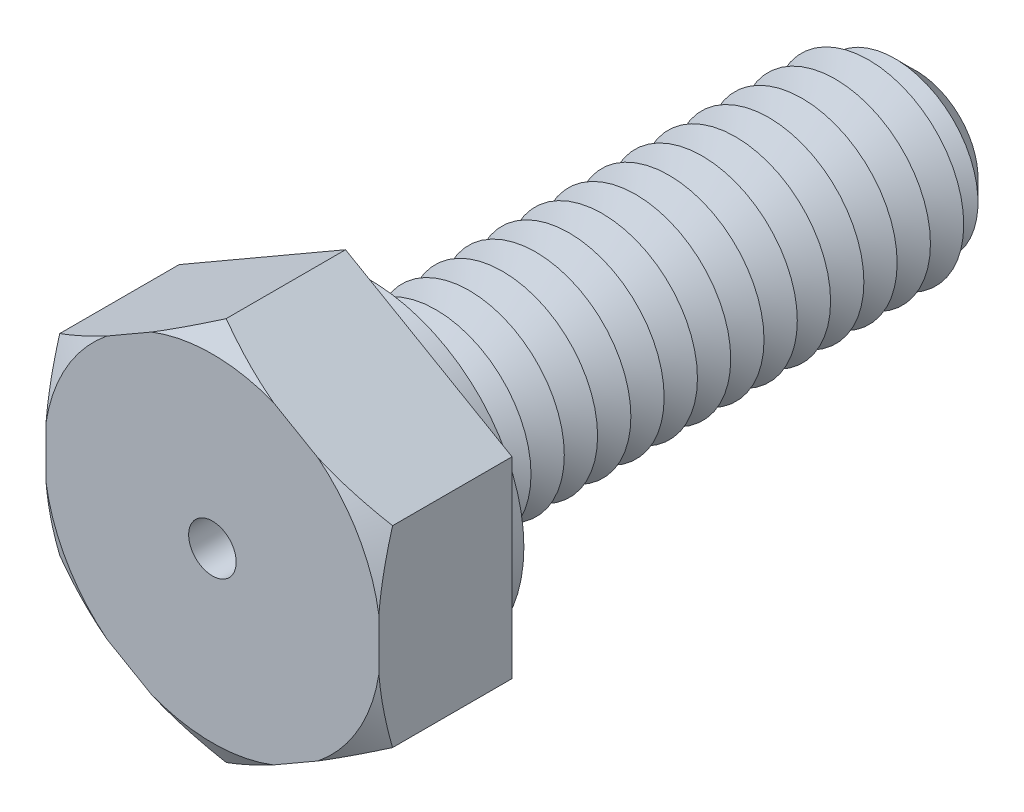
ISO-10303-21;
HEADER;
FILE_DESCRIPTION(('STEP AP214'),'2;1');
FILE_NAME('part.step','',(''),(''),'','','');
FILE_SCHEMA(('AUTOMOTIVE_DESIGN { 1 0 10303 214 1 1 1 1 }'));
ENDSEC;
DATA;
#1=APPLICATION_CONTEXT('core data for automotive mechanical design processes');
#2=APPLICATION_PROTOCOL_DEFINITION('international standard','automotive_design',2000,#1);
#3=PRODUCT_CONTEXT('',#1,'mechanical');
#4=PRODUCT('Part','Part','',(#3));
#5=PRODUCT_RELATED_PRODUCT_CATEGORY('part','',(#4));
#6=PRODUCT_DEFINITION_FORMATION('','',#4);
#7=PRODUCT_DEFINITION_CONTEXT('part definition',#1,'design');
#8=PRODUCT_DEFINITION('design','',#6,#7);
#9=PRODUCT_DEFINITION_SHAPE('','',#8);
#10=(LENGTH_UNIT() NAMED_UNIT(*) SI_UNIT(.MILLI.,.METRE.));
#11=(NAMED_UNIT(*) PLANE_ANGLE_UNIT() SI_UNIT($,.RADIAN.));
#12=(NAMED_UNIT(*) SI_UNIT($,.STERADIAN.) SOLID_ANGLE_UNIT());
#13=UNCERTAINTY_MEASURE_WITH_UNIT(LENGTH_MEASURE(1.E-05),#10,'distance_accuracy_value','');
#14=(GEOMETRIC_REPRESENTATION_CONTEXT(3) GLOBAL_UNCERTAINTY_ASSIGNED_CONTEXT((#13)) GLOBAL_UNIT_ASSIGNED_CONTEXT((#10,
#11,#12)) REPRESENTATION_CONTEXT('',''));
#15=CARTESIAN_POINT('',(0.,0.,0.));
#16=DIRECTION('',(0.,0.,1.));
#17=DIRECTION('',(1.,0.,0.));
#18=AXIS2_PLACEMENT_3D('',#15,#16,#17);
#19=CARTESIAN_POINT('',(3.5,2.02072594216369,2.8));
#20=DIRECTION('',(-0.5,-0.866025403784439,0.));
#21=DIRECTION('',(0.866025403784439,-0.5,0.));
#22=AXIS2_PLACEMENT_3D('',#19,#20,#21);
#23=PLANE('',#22);
#24=CARTESIAN_POINT('',(5.93124915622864,0.617043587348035,1.40176894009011));
#25=CARTESIAN_POINT('',(5.82127624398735,0.680536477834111,1.46111507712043));
#26=CARTESIAN_POINT('',(5.71104026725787,0.744181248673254,1.51982121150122));
#27=CARTESIAN_POINT('',(5.48993126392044,0.871838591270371,1.63565294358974));
#28=CARTESIAN_POINT('',(5.37905815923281,0.935851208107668,1.69277834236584));
#29=CARTESIAN_POINT('',(5.15623473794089,1.06449837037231,1.80531321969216));
#30=CARTESIAN_POINT('',(5.04428210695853,1.12913425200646,1.86071660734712));
#31=CARTESIAN_POINT('',(4.81953834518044,1.25889012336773,1.96920237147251));
#32=CARTESIAN_POINT('',(4.70674724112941,1.32401009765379,2.02228482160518));
#33=CARTESIAN_POINT('',(4.4773029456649,1.45647982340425,2.12693843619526));
#34=CARTESIAN_POINT('',(4.3606246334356,1.52384407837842,2.17843650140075));
#35=CARTESIAN_POINT('',(4.12610336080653,1.65924499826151,2.27776074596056));
#36=CARTESIAN_POINT('',(4.00826046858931,1.72728162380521,2.32558713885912));
#37=CARTESIAN_POINT('',(3.77136592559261,1.86405275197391,2.41666718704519));
#38=CARTESIAN_POINT('',(3.65231548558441,1.93278655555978,2.45992500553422));
#39=CARTESIAN_POINT('',(3.41281068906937,2.07106471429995,2.54086522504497));
#40=CARTESIAN_POINT('',(3.29235651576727,2.14060896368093,2.57854834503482));
#41=CARTESIAN_POINT('',(3.00433211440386,2.30689992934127,2.66006219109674));
#42=CARTESIAN_POINT('',(2.83610127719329,2.40402804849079,2.70086381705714));
#43=CARTESIAN_POINT('',(2.49725085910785,2.59966342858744,2.76622673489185));
#44=CARTESIAN_POINT('',(2.32663213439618,2.69817019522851,2.79079370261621));
#45=CARTESIAN_POINT('',(2.07079150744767,2.84587985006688,2.81342200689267));
#46=CARTESIAN_POINT('',(1.98601608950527,2.89482496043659,2.8186046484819));
#47=CARTESIAN_POINT('',(1.81634230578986,2.9927861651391,2.82423615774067));
#48=CARTESIAN_POINT('',(1.73144394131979,3.04180225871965,2.82468507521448));
#49=CARTESIAN_POINT('',(1.56172682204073,3.13978848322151,2.82082792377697));
#50=CARTESIAN_POINT('',(1.47690807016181,3.18875861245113,2.81652168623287));
#51=CARTESIAN_POINT('',(1.30753953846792,3.28654357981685,2.80328667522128));
#52=CARTESIAN_POINT('',(1.22298977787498,3.3353584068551,2.79435757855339));
#53=CARTESIAN_POINT('',(1.02330750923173,3.45064501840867,2.76803629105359));
#54=CARTESIAN_POINT('',(0.90836188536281,3.51700890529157,2.7487394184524));
#55=CARTESIAN_POINT('',(0.679569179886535,3.64910243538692,2.70286231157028));
#56=CARTESIAN_POINT('',(0.565722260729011,3.71483198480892,2.67628101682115));
#57=CARTESIAN_POINT('',(0.339141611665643,3.84564838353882,2.61683846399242));
#58=CARTESIAN_POINT('',(0.226409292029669,3.91073441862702,2.58397011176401));
#59=CARTESIAN_POINT('',(0.00220965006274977,4.04017614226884,2.512988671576));
#60=CARTESIAN_POINT('',(-0.109257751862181,4.10453187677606,2.47487591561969));
#61=CARTESIAN_POINT('',(-0.332327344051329,4.23332116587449,2.39383232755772));
#62=CARTESIAN_POINT('',(-0.443915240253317,4.29774646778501,2.35084938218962));
#63=CARTESIAN_POINT('',(-0.665905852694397,4.42591280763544,2.26126522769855));
#64=CARTESIAN_POINT('',(-0.776309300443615,4.48965426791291,2.2146664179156));
#65=CARTESIAN_POINT('',(-1.10600622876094,4.68000487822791,2.07044134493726));
#66=CARTESIAN_POINT('',(-1.32384189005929,4.80577235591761,1.96836549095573));
#67=CARTESIAN_POINT('',(-1.61545494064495,4.97413522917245,1.82536950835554));
#68=CARTESIAN_POINT('',(-1.69056073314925,5.01749757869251,1.78796601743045));
#69=CARTESIAN_POINT('',(-1.84044297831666,5.10403213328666,1.71229146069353));
#70=CARTESIAN_POINT('',(-1.91521944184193,5.14720434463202,1.67402042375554));
#71=CARTESIAN_POINT('',(-2.06368614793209,5.23292163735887,1.59712633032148));
#72=CARTESIAN_POINT('',(-2.13737951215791,5.27546852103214,1.55851128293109));
#73=CARTESIAN_POINT('',(-2.28450431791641,5.36041106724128,1.48061736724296));
#74=CARTESIAN_POINT('',(-2.35793575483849,5.40280672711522,1.44133848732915));
#75=CARTESIAN_POINT('',(-2.43124915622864,5.44513423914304,1.40176894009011));
#76=B_SPLINE_CURVE_WITH_KNOTS('',3,(#24,#25,#26,#27,#28,#29,#30,#31,#32,#33,#34,#35,#36,#37,#38,
#39,#40,#41,#42,#43,#44,#45,#46,#47,#48,#49,#50,#51,#52,#53,#54,#55,#56,#57,#58,#59,#60,#61,#62,
#63,#64,#65,#66,#67,#68,#69,#70,#71,#72,#73,#74,#75),.UNSPECIFIED.,.F.,.F.,(4,2,2,2,2,2,2,2,2,2,
2,2,2,2,2,2,2,2,2,2,2,2,2,2,2,4),(0.,0.420511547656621,0.841075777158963,1.26298883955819,
1.68488850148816,2.11755106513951,2.55018844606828,2.98242811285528,3.41461198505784,
4.0095520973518,4.60428410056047,4.89826759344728,5.19224799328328,5.48623881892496,
5.78025020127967,6.1823765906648,6.58456155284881,6.98720303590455,7.3898190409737,
7.7972442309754,8.20440134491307,9.01851321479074,9.30185450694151,9.58518638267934,
9.86552040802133,10.1458593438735),.UNSPECIFIED.);
#77=CARTESIAN_POINT('',(3.5,2.02072594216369,2.51132486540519));
#78=VERTEX_POINT('',#77);
#79=CARTESIAN_POINT('',(2.2178793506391,2.76095864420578,2.8));
#80=VERTEX_POINT('',#79);
#81=EDGE_CURVE('E132',#78,#80,#76,.T.);
#82=ORIENTED_EDGE('',*,*,#81,.F.);
#83=DIRECTION('',(0.,0.,-1.));
#84=VECTOR('',#83,1.);
#85=CARTESIAN_POINT('',(3.5,2.02072594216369,2.8));
#86=LINE('',#85,#84);
#87=CARTESIAN_POINT('',(3.5,2.02072594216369,0.));
#88=VERTEX_POINT('',#87);
#89=EDGE_CURVE('E144',#78,#88,#86,.T.);
#90=ORIENTED_EDGE('',*,*,#89,.T.);
#91=DIRECTION('',(-0.866025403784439,0.5,0.));
#92=VECTOR('',#91,1.);
#93=CARTESIAN_POINT('',(3.5,2.02072594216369,0.));
#94=LINE('',#93,#92);
#95=CARTESIAN_POINT('',(0.,4.04145188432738,0.));
#96=VERTEX_POINT('',#95);
#97=EDGE_CURVE('E333',#88,#96,#94,.T.);
#98=ORIENTED_EDGE('',*,*,#97,.T.);
#99=DIRECTION('',(0.,0.,-1.));
#100=VECTOR('',#99,1.);
#101=CARTESIAN_POINT('',(0.,4.04145188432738,2.8));
#102=LINE('',#101,#100);
#103=CARTESIAN_POINT('',(0.,4.04145188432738,2.51132486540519));
#104=VERTEX_POINT('',#103);
#105=EDGE_CURVE('E179',#104,#96,#102,.T.);
#106=ORIENTED_EDGE('',*,*,#105,.F.);
#107=CARTESIAN_POINT('',(1.2821206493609,3.30121918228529,2.8));
#108=VERTEX_POINT('',#107);
#109=EDGE_CURVE('E151',#108,#104,#76,.T.);
#110=ORIENTED_EDGE('',*,*,#109,.F.);
#111=DIRECTION('',(-0.866025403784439,0.5,0.));
#112=VECTOR('',#111,1.);
#113=CARTESIAN_POINT('',(3.5,2.02072594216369,2.8));
#114=LINE('',#113,#112);
#115=EDGE_CURVE('E148',#80,#108,#114,.T.);
#116=ORIENTED_EDGE('',*,*,#115,.F.);
#117=EDGE_LOOP('',(#82,#90,#98,#106,#110,#116));
#118=FACE_BOUND('',#117,.T.);
#119=ADVANCED_FACE('F39',(#118),#23,.F.);
#120=CARTESIAN_POINT('',(0.,4.04145188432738,2.8));
#121=DIRECTION('',(0.5,-0.866025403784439,0.));
#122=DIRECTION('',(0.866025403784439,0.5,0.));
#123=AXIS2_PLACEMENT_3D('',#120,#121,#122);
#124=PLANE('',#123);
#125=CARTESIAN_POINT('',(2.43124915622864,5.44513423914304,1.4017689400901));
#126=CARTESIAN_POINT('',(2.32127624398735,5.38164134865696,1.46111507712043));
#127=CARTESIAN_POINT('',(2.21104026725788,5.31799657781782,1.51982121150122));
#128=CARTESIAN_POINT('',(1.98993126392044,5.1903392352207,1.63565294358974));
#129=CARTESIAN_POINT('',(1.87905815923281,5.1263266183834,1.69277834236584));
#130=CARTESIAN_POINT('',(1.65623473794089,4.99767945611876,1.80531321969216));
#131=CARTESIAN_POINT('',(1.54428210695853,4.93304357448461,1.86071660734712));
#132=CARTESIAN_POINT('',(1.31953834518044,4.80328770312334,1.96920237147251));
#133=CARTESIAN_POINT('',(1.20674724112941,4.73816772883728,2.02228482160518));
#134=CARTESIAN_POINT('',(0.977302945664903,4.60569800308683,2.12693843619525));
#135=CARTESIAN_POINT('',(0.860624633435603,4.53833374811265,2.17843650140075));
#136=CARTESIAN_POINT('',(0.626103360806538,4.40293282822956,2.27776074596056));
#137=CARTESIAN_POINT('',(0.50826046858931,4.33489620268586,2.32558713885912));
#138=CARTESIAN_POINT('',(0.271365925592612,4.19812507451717,2.41666718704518));
#139=CARTESIAN_POINT('',(0.152315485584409,4.12939127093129,2.45992500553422));
#140=CARTESIAN_POINT('',(-0.0871893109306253,3.99111311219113,2.54086522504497));
#141=CARTESIAN_POINT('',(-0.207643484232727,3.92156886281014,2.57854834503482));
#142=CARTESIAN_POINT('',(-0.495667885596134,3.7552778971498,2.66006219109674));
#143=CARTESIAN_POINT('',(-0.663898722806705,3.65814977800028,2.70086381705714));
#144=CARTESIAN_POINT('',(-1.00274914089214,3.46251439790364,2.76622673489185));
#145=CARTESIAN_POINT('',(-1.17336786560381,3.36400763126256,2.79079370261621));
#146=CARTESIAN_POINT('',(-1.42920849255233,3.21629797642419,2.81342200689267));
#147=CARTESIAN_POINT('',(-1.51398391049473,3.16735286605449,2.8186046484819));
#148=CARTESIAN_POINT('',(-1.68365769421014,3.06939166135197,2.82423615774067));
#149=CARTESIAN_POINT('',(-1.7685560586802,3.02037556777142,2.82468507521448));
#150=CARTESIAN_POINT('',(-1.93827317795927,2.92238934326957,2.82082792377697));
#151=CARTESIAN_POINT('',(-2.02309192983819,2.87341921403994,2.81652168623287));
#152=CARTESIAN_POINT('',(-2.19246046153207,2.77563424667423,2.80328667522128));
#153=CARTESIAN_POINT('',(-2.27701022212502,2.72681941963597,2.79435757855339));
#154=CARTESIAN_POINT('',(-2.47669249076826,2.6115328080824,2.76803629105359));
#155=CARTESIAN_POINT('',(-2.59163811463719,2.54516892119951,2.7487394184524));
#156=CARTESIAN_POINT('',(-2.82043082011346,2.41307539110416,2.70286231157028));
#157=CARTESIAN_POINT('',(-2.93427773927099,2.34734584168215,2.67628101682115));
#158=CARTESIAN_POINT('',(-3.16085838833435,2.21652944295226,2.61683846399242));
#159=CARTESIAN_POINT('',(-3.27359070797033,2.15144340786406,2.58397011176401));
#160=CARTESIAN_POINT('',(-3.49779034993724,2.02200168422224,2.512988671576));
#161=CARTESIAN_POINT('',(-3.60925775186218,1.95764594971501,2.47487591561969));
#162=CARTESIAN_POINT('',(-3.83232734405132,1.82885666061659,2.39383232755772));
#163=CARTESIAN_POINT('',(-3.94391524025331,1.76443135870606,2.35084938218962));
#164=CARTESIAN_POINT('',(-4.16590585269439,1.63626501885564,2.26126522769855));
#165=CARTESIAN_POINT('',(-4.27630930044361,1.57252355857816,2.21466641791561));
#166=CARTESIAN_POINT('',(-4.60600622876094,1.38217294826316,2.07044134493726));
#167=CARTESIAN_POINT('',(-4.82384189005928,1.25640547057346,1.96836549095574));
#168=CARTESIAN_POINT('',(-5.11545494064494,1.08804259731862,1.82536950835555));
#169=CARTESIAN_POINT('',(-5.19056073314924,1.04468024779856,1.78796601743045));
#170=CARTESIAN_POINT('',(-5.34044297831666,0.958145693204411,1.71229146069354));
#171=CARTESIAN_POINT('',(-5.41521944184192,0.914973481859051,1.67402042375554));
#172=CARTESIAN_POINT('',(-5.56368614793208,0.829256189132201,1.59712633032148));
#173=CARTESIAN_POINT('',(-5.6373795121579,0.786709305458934,1.55851128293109));
#174=CARTESIAN_POINT('',(-5.78450431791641,0.701766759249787,1.48061736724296));
#175=CARTESIAN_POINT('',(-5.85793575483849,0.659371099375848,1.44133848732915));
#176=CARTESIAN_POINT('',(-5.93124915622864,0.617043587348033,1.40176894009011));
#177=B_SPLINE_CURVE_WITH_KNOTS('',3,(#125,#126,#127,#128,#129,#130,#131,#132,#133,#134,#135,
#136,#137,#138,#139,#140,#141,#142,#143,#144,#145,#146,#147,#148,#149,#150,#151,#152,#153,#154,
#155,#156,#157,#158,#159,#160,#161,#162,#163,#164,#165,#166,#167,#168,#169,#170,#171,#172,#173,
#174,#175,#176),.UNSPECIFIED.,.F.,.F.,(4,2,2,2,2,2,2,2,2,2,2,2,2,2,2,2,2,2,2,2,2,2,2,2,2,4),(0.,
0.420511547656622,0.841075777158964,1.26298883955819,1.68488850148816,2.11755106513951,
2.55018844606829,2.98242811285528,3.41461198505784,4.0095520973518,4.60428410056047,
4.89826759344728,5.19224799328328,5.48623881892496,5.78025020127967,6.1823765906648,
6.58456155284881,6.98720303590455,7.3898190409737,7.7972442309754,8.20440134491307,
9.01851321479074,9.30185450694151,9.58518638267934,9.86552040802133,10.1458593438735),.UNSPECIFIED.);
#178=CARTESIAN_POINT('',(-1.2821206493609,3.30121918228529,2.8));
#179=VERTEX_POINT('',#178);
#180=EDGE_CURVE('E995',#104,#179,#177,.T.);
#181=ORIENTED_EDGE('',*,*,#180,.F.);
#182=ORIENTED_EDGE('',*,*,#105,.T.);
#183=DIRECTION('',(-0.866025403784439,-0.5,0.));
#184=VECTOR('',#183,1.);
#185=CARTESIAN_POINT('',(0.,4.04145188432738,0.));
#186=LINE('',#185,#184);
#187=CARTESIAN_POINT('',(-3.5,2.02072594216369,0.));
#188=VERTEX_POINT('',#187);
#189=EDGE_CURVE('E351',#96,#188,#186,.T.);
#190=ORIENTED_EDGE('',*,*,#189,.T.);
#191=DIRECTION('',(0.,0.,-1.));
#192=VECTOR('',#191,1.);
#193=CARTESIAN_POINT('',(-3.5,2.02072594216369,2.8));
#194=LINE('',#193,#192);
#195=CARTESIAN_POINT('',(-3.5,2.02072594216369,2.51132486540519));
#196=VERTEX_POINT('',#195);
#197=EDGE_CURVE('E176',#196,#188,#194,.T.);
#198=ORIENTED_EDGE('',*,*,#197,.F.);
#199=CARTESIAN_POINT('',(-2.2178793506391,2.76095864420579,2.8));
#200=VERTEX_POINT('',#199);
#201=EDGE_CURVE('E432',#200,#196,#177,.T.);
#202=ORIENTED_EDGE('',*,*,#201,.F.);
#203=DIRECTION('',(-0.866025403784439,-0.5,0.));
#204=VECTOR('',#203,1.);
#205=CARTESIAN_POINT('',(0.,4.04145188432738,2.8));
#206=LINE('',#205,#204);
#207=EDGE_CURVE('E335',#179,#200,#206,.T.);
#208=ORIENTED_EDGE('',*,*,#207,.F.);
#209=EDGE_LOOP('',(#181,#182,#190,#198,#202,#208));
#210=FACE_BOUND('',#209,.T.);
#211=ADVANCED_FACE('F441',(#210),#124,.F.);
#212=CARTESIAN_POINT('',(-3.5,2.02072594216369,2.8));
#213=DIRECTION('',(1.,0.,0.));
#214=DIRECTION('',(0.,1.,0.));
#215=AXIS2_PLACEMENT_3D('',#212,#213,#214);
#216=PLANE('',#215);
#217=CARTESIAN_POINT('',(-3.5,4.45197509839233,1.57509745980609));
#218=CARTESIAN_POINT('',(-3.5,4.32552348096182,1.632476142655));
#219=CARTESIAN_POINT('',(-3.5,4.19872625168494,1.68910722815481));
#220=CARTESIAN_POINT('',(-3.5,3.94429210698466,1.80051165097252));
#221=CARTESIAN_POINT('',(-3.5,3.81665504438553,1.85528465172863));
#222=CARTESIAN_POINT('',(-3.5,3.55990351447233,1.96281335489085));
#223=CARTESIAN_POINT('',(-3.5,3.43078510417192,2.01555968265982));
#224=CARTESIAN_POINT('',(-3.5,3.17145843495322,2.11829034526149));
#225=CARTESIAN_POINT('',(-3.5,3.04125022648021,2.16827480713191));
#226=CARTESIAN_POINT('',(-3.5,2.78016103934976,2.26465408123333));
#227=CARTESIAN_POINT('',(-3.5,2.64928566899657,2.31106393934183));
#228=CARTESIAN_POINT('',(-3.5,2.38615329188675,2.39977727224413));
#229=CARTESIAN_POINT('',(-3.5,2.25389619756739,2.44208048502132));
#230=CARTESIAN_POINT('',(-3.5,1.85519063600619,2.56138283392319));
#231=CARTESIAN_POINT('',(-3.5,1.58637912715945,2.63093897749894));
#232=CARTESIAN_POINT('',(-3.5,1.11975855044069,2.72563856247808));
#233=CARTESIAN_POINT('',(-3.5,0.923391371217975,2.75778053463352));
#234=CARTESIAN_POINT('',(-3.5,0.528527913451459,2.80406409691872));
#235=CARTESIAN_POINT('',(-3.5,0.330032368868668,2.81821170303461));
#236=CARTESIAN_POINT('',(-3.5,-0.0672968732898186,2.82680706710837));
#237=CARTESIAN_POINT('',(-3.5,-0.266130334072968,2.82126532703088));
#238=CARTESIAN_POINT('',(-3.5,-0.662321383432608,2.79120496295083));
#239=CARTESIAN_POINT('',(-3.5,-0.859678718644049,2.76668315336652));
#240=CARTESIAN_POINT('',(-3.5,-1.34971804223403,2.68500356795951));
#241=CARTESIAN_POINT('',(-3.5,-1.64068160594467,2.61765497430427));
#242=CARTESIAN_POINT('',(-3.5,-2.07181303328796,2.497569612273));
#243=CARTESIAN_POINT('',(-3.5,-2.21482517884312,2.45429352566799));
#244=CARTESIAN_POINT('',(-3.5,-2.49919378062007,2.36258423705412));
#245=CARTESIAN_POINT('',(-3.5,-2.64055035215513,2.31415139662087));
#246=CARTESIAN_POINT('',(-3.5,-2.92337235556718,2.2125676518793));
#247=CARTESIAN_POINT('',(-3.5,-3.06482042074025,2.15936898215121));
#248=CARTESIAN_POINT('',(-3.5,-3.34639535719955,2.04956763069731));
#249=CARTESIAN_POINT('',(-3.5,-3.48652214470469,1.99296473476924));
#250=CARTESIAN_POINT('',(-3.5,-3.76476497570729,1.87738368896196));
#251=CARTESIAN_POINT('',(-3.5,-3.90288810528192,1.81842250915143));
#252=CARTESIAN_POINT('',(-3.5,-4.1781332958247,1.6982956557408));
#253=CARTESIAN_POINT('',(-3.5,-4.31525559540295,1.6371305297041));
#254=CARTESIAN_POINT('',(-3.5,-4.45197509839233,1.57509745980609));
#255=B_SPLINE_CURVE_WITH_KNOTS('',3,(#217,#218,#219,#220,#221,#222,#223,#224,#225,#226,#227,
#228,#229,#230,#231,#232,#233,#234,#235,#236,#237,#238,#239,#240,#241,#242,#243,#244,#245,#246,
#247,#248,#249,#250,#251,#252,#253,#254),.UNSPECIFIED.,.F.,.F.,(4,2,2,2,2,2,2,2,2,2,2,2,2,2,2,2,
2,2,4),(0.,0.416588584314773,0.83325222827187,1.251655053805,1.67003861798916,2.08655215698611,
2.50309225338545,3.3347974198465,3.93106101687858,4.52712521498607,5.12287153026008,
5.71871785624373,6.61272902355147,7.06093271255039,7.50910499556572,7.9624204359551,
8.41576442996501,8.86628772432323,9.31669984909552),.UNSPECIFIED.);
#256=CARTESIAN_POINT('',(-3.5,0.540260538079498,2.8));
#257=VERTEX_POINT('',#256);
#258=EDGE_CURVE('E430',#196,#257,#255,.T.);
#259=ORIENTED_EDGE('',*,*,#258,.F.);
#260=ORIENTED_EDGE('',*,*,#197,.T.);
#261=DIRECTION('',(0.,-1.,0.));
#262=VECTOR('',#261,1.);
#263=CARTESIAN_POINT('',(-3.5,2.02072594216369,0.));
#264=LINE('',#263,#262);
#265=CARTESIAN_POINT('',(-3.5,-2.02072594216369,0.));
#266=VERTEX_POINT('',#265);
#267=EDGE_CURVE('E355',#188,#266,#264,.T.);
#268=ORIENTED_EDGE('',*,*,#267,.T.);
#269=DIRECTION('',(0.,0.,-1.));
#270=VECTOR('',#269,1.);
#271=CARTESIAN_POINT('',(-3.5,-2.02072594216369,2.8));
#272=LINE('',#271,#270);
#273=CARTESIAN_POINT('',(-3.5,-2.02072594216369,2.51132486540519));
#274=VERTEX_POINT('',#273);
#275=EDGE_CURVE('E173',#274,#266,#272,.T.);
#276=ORIENTED_EDGE('',*,*,#275,.F.);
#277=CARTESIAN_POINT('',(-3.5,-0.540260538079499,2.8));
#278=VERTEX_POINT('',#277);
#279=EDGE_CURVE('E424',#278,#274,#255,.T.);
#280=ORIENTED_EDGE('',*,*,#279,.F.);
#281=DIRECTION('',(0.,-1.,0.));
#282=VECTOR('',#281,1.);
#283=CARTESIAN_POINT('',(-3.5,2.02072594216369,2.8));
#284=LINE('',#283,#282);
#285=EDGE_CURVE('E339',#257,#278,#284,.T.);
#286=ORIENTED_EDGE('',*,*,#285,.F.);
#287=EDGE_LOOP('',(#259,#260,#268,#276,#280,#286));
#288=FACE_BOUND('',#287,.T.);
#289=ADVANCED_FACE('F437',(#288),#216,.F.);
#290=CARTESIAN_POINT('',(-3.5,-2.02072594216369,2.8));
#291=DIRECTION('',(0.5,0.866025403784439,0.));
#292=DIRECTION('',(-0.866025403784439,0.5,0.));
#293=AXIS2_PLACEMENT_3D('',#290,#291,#292);
#294=PLANE('',#293);
#295=CARTESIAN_POINT('',(-5.93124915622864,-0.617043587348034,1.4017689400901));
#296=CARTESIAN_POINT('',(-5.82127624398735,-0.68053647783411,1.46111507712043));
#297=CARTESIAN_POINT('',(-5.71104026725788,-0.744181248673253,1.51982121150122));
#298=CARTESIAN_POINT('',(-5.48993126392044,-0.87183859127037,1.63565294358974));
#299=CARTESIAN_POINT('',(-5.37905815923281,-0.935851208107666,1.69277834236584));
#300=CARTESIAN_POINT('',(-5.15623473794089,-1.06449837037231,1.80531321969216));
#301=CARTESIAN_POINT('',(-5.04428210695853,-1.12913425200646,1.86071660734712));
#302=CARTESIAN_POINT('',(-4.81953834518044,-1.25889012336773,1.96920237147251));
#303=CARTESIAN_POINT('',(-4.70674724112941,-1.32401009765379,2.02228482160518));
#304=CARTESIAN_POINT('',(-4.4773029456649,-1.45647982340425,2.12693843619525));
#305=CARTESIAN_POINT('',(-4.3606246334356,-1.52384407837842,2.17843650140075));
#306=CARTESIAN_POINT('',(-4.12610336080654,-1.65924499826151,2.27776074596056));
#307=CARTESIAN_POINT('',(-4.00826046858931,-1.72728162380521,2.32558713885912));
#308=CARTESIAN_POINT('',(-3.77136592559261,-1.8640527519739,2.41666718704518));
#309=CARTESIAN_POINT('',(-3.65231548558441,-1.93278655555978,2.45992500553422));
#310=CARTESIAN_POINT('',(-3.41281068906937,-2.07106471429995,2.54086522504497));
#311=CARTESIAN_POINT('',(-3.29235651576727,-2.14060896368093,2.57854834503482));
#312=CARTESIAN_POINT('',(-3.00433211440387,-2.30689992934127,2.66006219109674));
#313=CARTESIAN_POINT('',(-2.83610127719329,-2.40402804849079,2.70086381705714));
#314=CARTESIAN_POINT('',(-2.49725085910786,-2.59966342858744,2.76622673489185));
#315=CARTESIAN_POINT('',(-2.32663213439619,-2.69817019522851,2.79079370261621));
#316=CARTESIAN_POINT('',(-2.07079150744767,-2.84587985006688,2.81342200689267));
#317=CARTESIAN_POINT('',(-1.98601608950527,-2.89482496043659,2.8186046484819));
#318=CARTESIAN_POINT('',(-1.81634230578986,-2.9927861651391,2.82423615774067));
#319=CARTESIAN_POINT('',(-1.7314439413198,-3.04180225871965,2.82468507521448));
#320=CARTESIAN_POINT('',(-1.56172682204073,-3.13978848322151,2.82082792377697));
#321=CARTESIAN_POINT('',(-1.47690807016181,-3.18875861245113,2.81652168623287));
#322=CARTESIAN_POINT('',(-1.30753953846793,-3.28654357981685,2.80328667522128));
#323=CARTESIAN_POINT('',(-1.22298977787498,-3.3353584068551,2.79435757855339));
#324=CARTESIAN_POINT('',(-1.02330750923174,-3.45064501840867,2.76803629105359));
#325=CARTESIAN_POINT('',(-0.908361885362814,-3.51700890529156,2.7487394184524));
#326=CARTESIAN_POINT('',(-0.679569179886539,-3.64910243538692,2.70286231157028));
#327=CARTESIAN_POINT('',(-0.565722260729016,-3.71483198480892,2.67628101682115));
#328=CARTESIAN_POINT('',(-0.339141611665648,-3.84564838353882,2.61683846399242));
#329=CARTESIAN_POINT('',(-0.226409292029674,-3.91073441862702,2.58397011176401));
#330=CARTESIAN_POINT('',(-0.00220965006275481,-4.04017614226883,2.512988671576));
#331=CARTESIAN_POINT('',(0.109257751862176,-4.10453187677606,2.47487591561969));
#332=CARTESIAN_POINT('',(0.332327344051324,-4.23332116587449,2.39383232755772));
#333=CARTESIAN_POINT('',(0.443915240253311,-4.29774646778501,2.35084938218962));
#334=CARTESIAN_POINT('',(0.665905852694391,-4.42591280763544,2.26126522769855));
#335=CARTESIAN_POINT('',(0.776309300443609,-4.48965426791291,2.2146664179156));
#336=CARTESIAN_POINT('',(1.10600622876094,-4.68000487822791,2.07044134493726));
#337=CARTESIAN_POINT('',(1.32384189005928,-4.80577235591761,1.96836549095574));
#338=CARTESIAN_POINT('',(1.61545494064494,-4.97413522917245,1.82536950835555));
#339=CARTESIAN_POINT('',(1.69056073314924,-5.01749757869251,1.78796601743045));
#340=CARTESIAN_POINT('',(1.84044297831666,-5.10403213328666,1.71229146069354));
#341=CARTESIAN_POINT('',(1.91521944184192,-5.14720434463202,1.67402042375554));
#342=CARTESIAN_POINT('',(2.06368614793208,-5.23292163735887,1.59712633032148));
#343=CARTESIAN_POINT('',(2.1373795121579,-5.27546852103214,1.55851128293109));
#344=CARTESIAN_POINT('',(2.28450431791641,-5.36041106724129,1.48061736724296));
#345=CARTESIAN_POINT('',(2.35793575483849,-5.40280672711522,1.44133848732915));
#346=CARTESIAN_POINT('',(2.43124915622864,-5.44513423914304,1.40176894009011));
#347=B_SPLINE_CURVE_WITH_KNOTS('',3,(#295,#296,#297,#298,#299,#300,#301,#302,#303,#304,#305,
#306,#307,#308,#309,#310,#311,#312,#313,#314,#315,#316,#317,#318,#319,#320,#321,#322,#323,#324,
#325,#326,#327,#328,#329,#330,#331,#332,#333,#334,#335,#336,#337,#338,#339,#340,#341,#342,#343,
#344,#345,#346),.UNSPECIFIED.,.F.,.F.,(4,2,2,2,2,2,2,2,2,2,2,2,2,2,2,2,2,2,2,2,2,2,2,2,2,4),(0.,
0.420511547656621,0.841075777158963,1.26298883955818,1.68488850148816,2.11755106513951,
2.55018844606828,2.98242811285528,3.41461198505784,4.00955209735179,4.60428410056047,
4.89826759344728,5.19224799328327,5.48623881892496,5.78025020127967,6.1823765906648,
6.58456155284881,6.98720303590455,7.38981904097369,7.7972442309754,8.20440134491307,
9.01851321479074,9.30185450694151,9.58518638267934,9.86552040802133,10.1458593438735),.UNSPECIFIED.);
#348=CARTESIAN_POINT('',(-2.2178793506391,-2.76095864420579,2.8));
#349=VERTEX_POINT('',#348);
#350=EDGE_CURVE('E431',#274,#349,#347,.T.);
#351=ORIENTED_EDGE('',*,*,#350,.F.);
#352=ORIENTED_EDGE('',*,*,#275,.T.);
#353=DIRECTION('',(0.866025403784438,-0.5,0.));
#354=VECTOR('',#353,1.);
#355=CARTESIAN_POINT('',(-3.5,-2.02072594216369,0.));
#356=LINE('',#355,#354);
#357=CARTESIAN_POINT('',(0.,-4.04145188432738,0.));
#358=VERTEX_POINT('',#357);
#359=EDGE_CURVE('E359',#266,#358,#356,.T.);
#360=ORIENTED_EDGE('',*,*,#359,.T.);
#361=DIRECTION('',(0.,0.,-1.));
#362=VECTOR('',#361,1.);
#363=CARTESIAN_POINT('',(0.,-4.04145188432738,2.8));
#364=LINE('',#363,#362);
#365=CARTESIAN_POINT('',(0.,-4.04145188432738,2.51132486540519));
#366=VERTEX_POINT('',#365);
#367=EDGE_CURVE('E163',#366,#358,#364,.T.);
#368=ORIENTED_EDGE('',*,*,#367,.F.);
#369=CARTESIAN_POINT('',(-1.2821206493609,-3.30121918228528,2.8));
#370=VERTEX_POINT('',#369);
#371=EDGE_CURVE('E388',#370,#366,#347,.T.);
#372=ORIENTED_EDGE('',*,*,#371,.F.);
#373=DIRECTION('',(0.866025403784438,-0.5,0.));
#374=VECTOR('',#373,1.);
#375=CARTESIAN_POINT('',(-3.5,-2.02072594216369,2.8));
#376=LINE('',#375,#374);
#377=EDGE_CURVE('E342',#349,#370,#376,.T.);
#378=ORIENTED_EDGE('',*,*,#377,.F.);
#379=EDGE_LOOP('',(#351,#352,#360,#368,#372,#378));
#380=FACE_BOUND('',#379,.T.);
#381=ADVANCED_FACE('F440',(#380),#294,.F.);
#382=CARTESIAN_POINT('',(0.,-4.04145188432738,2.8));
#383=DIRECTION('',(-0.5,0.866025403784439,0.));
#384=DIRECTION('',(-0.866025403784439,-0.5,0.));
#385=AXIS2_PLACEMENT_3D('',#382,#383,#384);
#386=PLANE('',#385);
#387=CARTESIAN_POINT('',(-2.43124915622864,-5.44513423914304,1.4017689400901));
#388=CARTESIAN_POINT('',(-2.32127624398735,-5.38164134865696,1.46111507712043));
#389=CARTESIAN_POINT('',(-2.21104026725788,-5.31799657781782,1.51982121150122));
#390=CARTESIAN_POINT('',(-1.98993126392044,-5.1903392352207,1.63565294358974));
#391=CARTESIAN_POINT('',(-1.87905815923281,-5.1263266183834,1.69277834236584));
#392=CARTESIAN_POINT('',(-1.65623473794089,-4.99767945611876,1.80531321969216));
#393=CARTESIAN_POINT('',(-1.54428210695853,-4.93304357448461,1.86071660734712));
#394=CARTESIAN_POINT('',(-1.31953834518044,-4.80328770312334,1.96920237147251));
#395=CARTESIAN_POINT('',(-1.20674724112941,-4.73816772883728,2.02228482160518));
#396=CARTESIAN_POINT('',(-0.977302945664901,-4.60569800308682,2.12693843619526));
#397=CARTESIAN_POINT('',(-0.860624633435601,-4.53833374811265,2.17843650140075));
#398=CARTESIAN_POINT('',(-0.626103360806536,-4.40293282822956,2.27776074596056));
#399=CARTESIAN_POINT('',(-0.508260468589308,-4.33489620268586,2.32558713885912));
#400=CARTESIAN_POINT('',(-0.27136592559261,-4.19812507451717,2.41666718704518));
#401=CARTESIAN_POINT('',(-0.152315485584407,-4.12939127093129,2.45992500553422));
#402=CARTESIAN_POINT('',(0.0871893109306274,-3.99111311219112,2.54086522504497));
#403=CARTESIAN_POINT('',(0.20764348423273,-3.92156886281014,2.57854834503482));
#404=CARTESIAN_POINT('',(0.495667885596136,-3.7552778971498,2.66006219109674));
#405=CARTESIAN_POINT('',(0.663898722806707,-3.65814977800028,2.70086381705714));
#406=CARTESIAN_POINT('',(1.00274914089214,-3.46251439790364,2.76622673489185));
#407=CARTESIAN_POINT('',(1.17336786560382,-3.36400763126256,2.79079370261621));
#408=CARTESIAN_POINT('',(1.42920849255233,-3.21629797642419,2.81342200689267));
#409=CARTESIAN_POINT('',(1.51398391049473,-3.16735286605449,2.8186046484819));
#410=CARTESIAN_POINT('',(1.68365769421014,-3.06939166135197,2.82423615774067));
#411=CARTESIAN_POINT('',(1.76855605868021,-3.02037556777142,2.82468507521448));
#412=CARTESIAN_POINT('',(1.93827317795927,-2.92238934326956,2.82082792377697));
#413=CARTESIAN_POINT('',(2.02309192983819,-2.87341921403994,2.81652168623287));
#414=CARTESIAN_POINT('',(2.19246046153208,-2.77563424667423,2.80328667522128));
#415=CARTESIAN_POINT('',(2.27701022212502,-2.72681941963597,2.79435757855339));
#416=CARTESIAN_POINT('',(2.47669249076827,-2.6115328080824,2.76803629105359));
#417=CARTESIAN_POINT('',(2.59163811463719,-2.54516892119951,2.7487394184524));
#418=CARTESIAN_POINT('',(2.82043082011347,-2.41307539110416,2.70286231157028));
#419=CARTESIAN_POINT('',(2.93427773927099,-2.34734584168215,2.67628101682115));
#420=CARTESIAN_POINT('',(3.16085838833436,-2.21652944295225,2.61683846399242));
#421=CARTESIAN_POINT('',(3.27359070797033,-2.15144340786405,2.58397011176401));
#422=CARTESIAN_POINT('',(3.49779034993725,-2.02200168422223,2.512988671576));
#423=CARTESIAN_POINT('',(3.60925775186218,-1.95764594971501,2.47487591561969));
#424=CARTESIAN_POINT('',(3.83232734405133,-1.82885666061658,2.39383232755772));
#425=CARTESIAN_POINT('',(3.94391524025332,-1.76443135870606,2.35084938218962));
#426=CARTESIAN_POINT('',(4.1659058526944,-1.63626501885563,2.26126522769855));
#427=CARTESIAN_POINT('',(4.27630930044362,-1.57252355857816,2.2146664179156));
#428=CARTESIAN_POINT('',(4.60600622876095,-1.38217294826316,2.07044134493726));
#429=CARTESIAN_POINT('',(4.82384189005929,-1.25640547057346,1.96836549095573));
#430=CARTESIAN_POINT('',(5.11545494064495,-1.08804259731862,1.82536950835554));
#431=CARTESIAN_POINT('',(5.19056073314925,-1.04468024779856,1.78796601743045));
#432=CARTESIAN_POINT('',(5.34044297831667,-0.95814569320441,1.71229146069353));
#433=CARTESIAN_POINT('',(5.41521944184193,-0.914973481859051,1.67402042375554));
#434=CARTESIAN_POINT('',(5.56368614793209,-0.829256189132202,1.59712633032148));
#435=CARTESIAN_POINT('',(5.63737951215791,-0.786709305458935,1.55851128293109));
#436=CARTESIAN_POINT('',(5.78450431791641,-0.70176675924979,1.48061736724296));
#437=CARTESIAN_POINT('',(5.85793575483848,-0.659371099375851,1.44133848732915));
#438=CARTESIAN_POINT('',(5.93124915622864,-0.617043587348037,1.40176894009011));
#439=B_SPLINE_CURVE_WITH_KNOTS('',3,(#387,#388,#389,#390,#391,#392,#393,#394,#395,#396,#397,
#398,#399,#400,#401,#402,#403,#404,#405,#406,#407,#408,#409,#410,#411,#412,#413,#414,#415,#416,
#417,#418,#419,#420,#421,#422,#423,#424,#425,#426,#427,#428,#429,#430,#431,#432,#433,#434,#435,
#436,#437,#438),.UNSPECIFIED.,.F.,.F.,(4,2,2,2,2,2,2,2,2,2,2,2,2,2,2,2,2,2,2,2,2,2,2,2,2,4),(0.,
0.420511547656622,0.841075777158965,1.26298883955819,1.68488850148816,2.11755106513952,
2.55018844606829,2.98242811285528,3.41461198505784,4.0095520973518,4.60428410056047,
4.89826759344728,5.19224799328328,5.48623881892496,5.78025020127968,6.18237659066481,
6.58456155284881,6.98720303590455,7.3898190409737,7.79724423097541,8.20440134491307,
9.01851321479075,9.30185450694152,9.58518638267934,9.86552040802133,10.1458593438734),.UNSPECIFIED.);
#440=CARTESIAN_POINT('',(1.2821206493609,-3.30121918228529,2.8));
#441=VERTEX_POINT('',#440);
#442=EDGE_CURVE('E64',#366,#441,#439,.T.);
#443=ORIENTED_EDGE('',*,*,#442,.F.);
#444=ORIENTED_EDGE('',*,*,#367,.T.);
#445=DIRECTION('',(0.866025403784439,0.5,0.));
#446=VECTOR('',#445,1.);
#447=CARTESIAN_POINT('',(0.,-4.04145188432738,0.));
#448=LINE('',#447,#446);
#449=CARTESIAN_POINT('',(3.5,-2.02072594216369,0.));
#450=VERTEX_POINT('',#449);
#451=EDGE_CURVE('E362',#358,#450,#448,.T.);
#452=ORIENTED_EDGE('',*,*,#451,.T.);
#453=DIRECTION('',(0.,0.,-1.));
#454=VECTOR('',#453,1.);
#455=CARTESIAN_POINT('',(3.5,-2.02072594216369,2.8));
#456=LINE('',#455,#454);
#457=CARTESIAN_POINT('',(3.5,-2.02072594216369,2.51132486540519));
#458=VERTEX_POINT('',#457);
#459=EDGE_CURVE('E157',#458,#450,#456,.T.);
#460=ORIENTED_EDGE('',*,*,#459,.F.);
#461=CARTESIAN_POINT('',(2.2178793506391,-2.76095864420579,2.8));
#462=VERTEX_POINT('',#461);
#463=EDGE_CURVE('E383',#462,#458,#439,.T.);
#464=ORIENTED_EDGE('',*,*,#463,.F.);
#465=DIRECTION('',(0.866025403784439,0.5,0.));
#466=VECTOR('',#465,1.);
#467=CARTESIAN_POINT('',(0.,-4.04145188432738,2.8));
#468=LINE('',#467,#466);
#469=EDGE_CURVE('E166',#441,#462,#468,.T.);
#470=ORIENTED_EDGE('',*,*,#469,.F.);
#471=EDGE_LOOP('',(#443,#444,#452,#460,#464,#470));
#472=FACE_BOUND('',#471,.T.);
#473=ADVANCED_FACE('F384',(#472),#386,.F.);
#474=CARTESIAN_POINT('',(3.5,-2.02072594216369,2.8));
#475=DIRECTION('',(-1.,0.,0.));
#476=DIRECTION('',(0.,-1.,0.));
#477=AXIS2_PLACEMENT_3D('',#474,#475,#476);
#478=PLANE('',#477);
#479=CARTESIAN_POINT('',(3.5,-4.45197509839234,1.57509745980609));
#480=CARTESIAN_POINT('',(3.5,-4.32552348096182,1.632476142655));
#481=CARTESIAN_POINT('',(3.5,-4.19872625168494,1.68910722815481));
#482=CARTESIAN_POINT('',(3.5,-3.94429210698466,1.80051165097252));
#483=CARTESIAN_POINT('',(3.5,-3.81665504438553,1.85528465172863));
#484=CARTESIAN_POINT('',(3.5,-3.55990351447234,1.96281335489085));
#485=CARTESIAN_POINT('',(3.5,-3.43078510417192,2.01555968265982));
#486=CARTESIAN_POINT('',(3.5,-3.17145843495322,2.11829034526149));
#487=CARTESIAN_POINT('',(3.5,-3.04125022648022,2.16827480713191));
#488=CARTESIAN_POINT('',(3.5,-2.78016103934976,2.26465408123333));
#489=CARTESIAN_POINT('',(3.5,-2.64928566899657,2.31106393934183));
#490=CARTESIAN_POINT('',(3.5,-2.38615329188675,2.39977727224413));
#491=CARTESIAN_POINT('',(3.5,-2.25389619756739,2.44208048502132));
#492=CARTESIAN_POINT('',(3.5,-1.85519063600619,2.56138283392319));
#493=CARTESIAN_POINT('',(3.5,-1.58637912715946,2.63093897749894));
#494=CARTESIAN_POINT('',(3.5,-1.11975855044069,2.72563856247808));
#495=CARTESIAN_POINT('',(3.5,-0.923391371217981,2.75778053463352));
#496=CARTESIAN_POINT('',(3.5,-0.528527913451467,2.80406409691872));
#497=CARTESIAN_POINT('',(3.5,-0.330032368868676,2.81821170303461));
#498=CARTESIAN_POINT('',(3.5,0.0672968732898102,2.82680706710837));
#499=CARTESIAN_POINT('',(3.5,0.26613033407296,2.82126532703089));
#500=CARTESIAN_POINT('',(3.5,0.662321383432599,2.79120496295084));
#501=CARTESIAN_POINT('',(3.5,0.85967871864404,2.76668315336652));
#502=CARTESIAN_POINT('',(3.5,1.34971804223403,2.68500356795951));
#503=CARTESIAN_POINT('',(3.5,1.64068160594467,2.61765497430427));
#504=CARTESIAN_POINT('',(3.5,2.07181303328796,2.497569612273));
#505=CARTESIAN_POINT('',(3.5,2.21482517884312,2.45429352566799));
#506=CARTESIAN_POINT('',(3.5,2.49919378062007,2.36258423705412));
#507=CARTESIAN_POINT('',(3.5,2.64055035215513,2.31415139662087));
#508=CARTESIAN_POINT('',(3.5,2.92337235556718,2.2125676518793));
#509=CARTESIAN_POINT('',(3.5,3.06482042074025,2.15936898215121));
#510=CARTESIAN_POINT('',(3.5,3.34639535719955,2.04956763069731));
#511=CARTESIAN_POINT('',(3.5,3.48652214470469,1.99296473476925));
#512=CARTESIAN_POINT('',(3.5,3.76476497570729,1.87738368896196));
#513=CARTESIAN_POINT('',(3.5,3.90288810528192,1.81842250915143));
#514=CARTESIAN_POINT('',(3.5,4.1781332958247,1.6982956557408));
#515=CARTESIAN_POINT('',(3.5,4.31525559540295,1.6371305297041));
#516=CARTESIAN_POINT('',(3.5,4.45197509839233,1.57509745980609));
#517=B_SPLINE_CURVE_WITH_KNOTS('',3,(#479,#480,#481,#482,#483,#484,#485,#486,#487,#488,#489,
#490,#491,#492,#493,#494,#495,#496,#497,#498,#499,#500,#501,#502,#503,#504,#505,#506,#507,#508,
#509,#510,#511,#512,#513,#514,#515,#516),.UNSPECIFIED.,.F.,.F.,(4,2,2,2,2,2,2,2,2,2,2,2,2,2,2,2,
2,2,4),(0.,0.416588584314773,0.83325222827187,1.251655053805,1.67003861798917,2.08655215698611,
2.50309225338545,3.33479741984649,3.93106101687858,4.52712521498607,5.12287153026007,
5.71871785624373,6.61272902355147,7.0609327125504,7.50910499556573,7.96242043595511,
8.41576442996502,8.86628772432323,9.31669984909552),.UNSPECIFIED.);
#518=CARTESIAN_POINT('',(3.5,-0.540260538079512,2.8));
#519=VERTEX_POINT('',#518);
#520=EDGE_CURVE('E56',#458,#519,#517,.T.);
#521=ORIENTED_EDGE('',*,*,#520,.F.);
#522=ORIENTED_EDGE('',*,*,#459,.T.);
#523=DIRECTION('',(0.,1.,0.));
#524=VECTOR('',#523,1.);
#525=CARTESIAN_POINT('',(3.5,-2.02072594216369,0.));
#526=LINE('',#525,#524);
#527=EDGE_CURVE('E154',#450,#88,#526,.T.);
#528=ORIENTED_EDGE('',*,*,#527,.T.);
#529=ORIENTED_EDGE('',*,*,#89,.F.);
#530=CARTESIAN_POINT('',(3.5,0.540260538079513,2.8));
#531=VERTEX_POINT('',#530);
#532=EDGE_CURVE('E129',#531,#78,#517,.T.);
#533=ORIENTED_EDGE('',*,*,#532,.F.);
#534=DIRECTION('',(0.,1.,0.));
#535=VECTOR('',#534,1.);
#536=CARTESIAN_POINT('',(3.5,-2.02072594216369,2.8));
#537=LINE('',#536,#535);
#538=EDGE_CURVE('E158',#519,#531,#537,.T.);
#539=ORIENTED_EDGE('',*,*,#538,.F.);
#540=EDGE_LOOP('',(#521,#522,#528,#529,#533,#539));
#541=FACE_BOUND('',#540,.T.);
#542=ADVANCED_FACE('F152',(#541),#478,.F.);
#543=CARTESIAN_POINT('',(0.,0.,2.8));
#544=DIRECTION('',(0.,0.,1.));
#545=DIRECTION('',(1.,0.,0.));
#546=AXIS2_PLACEMENT_3D('',#543,#544,#545);
#547=PLANE('',#546);
#548=CARTESIAN_POINT('',(0.,0.,2.8));
#549=DIRECTION('',(0.,0.,1.));
#550=DIRECTION('',(1.,0.,0.));
#551=AXIS2_PLACEMENT_3D('',#548,#549,#550);
#552=CIRCLE('',#551,0.5);
#553=CARTESIAN_POINT('',(0.5,0.,2.8));
#554=VERTEX_POINT('',#553);
#555=EDGE_CURVE('E970',#554,#554,#552,.T.);
#556=ORIENTED_EDGE('',*,*,#555,.F.);
#557=EDGE_LOOP('',(#556));
#558=FACE_BOUND('',#557,.T.);
#559=ORIENTED_EDGE('',*,*,#538,.T.);
#560=CARTESIAN_POINT('',(0.,0.,2.8));
#561=DIRECTION('',(0.,0.,1.));
#562=DIRECTION('',(1.,0.,0.));
#563=AXIS2_PLACEMENT_3D('',#560,#561,#562);
#564=CIRCLE('',#563,3.54145188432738);
#565=EDGE_CURVE('E134',#531,#80,#564,.T.);
#566=ORIENTED_EDGE('',*,*,#565,.T.);
#567=ORIENTED_EDGE('',*,*,#115,.T.);
#568=CARTESIAN_POINT('',(0.,0.,2.8));
#569=DIRECTION('',(0.,0.,1.));
#570=DIRECTION('',(1.,0.,0.));
#571=AXIS2_PLACEMENT_3D('',#568,#569,#570);
#572=CIRCLE('',#571,3.54145188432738);
#573=EDGE_CURVE('E11',#108,#179,#572,.T.);
#574=ORIENTED_EDGE('',*,*,#573,.T.);
#575=ORIENTED_EDGE('',*,*,#207,.T.);
#576=EDGE_CURVE('E49',#200,#257,#572,.T.);
#577=ORIENTED_EDGE('',*,*,#576,.T.);
#578=ORIENTED_EDGE('',*,*,#285,.T.);
#579=EDGE_CURVE('E371',#278,#349,#572,.T.);
#580=ORIENTED_EDGE('',*,*,#579,.T.);
#581=ORIENTED_EDGE('',*,*,#377,.T.);
#582=EDGE_CURVE('E373',#370,#441,#572,.T.);
#583=ORIENTED_EDGE('',*,*,#582,.T.);
#584=ORIENTED_EDGE('',*,*,#469,.T.);
#585=EDGE_CURVE('E43',#462,#519,#572,.T.);
#586=ORIENTED_EDGE('',*,*,#585,.T.);
#587=EDGE_LOOP('',(#559,#566,#567,#574,#575,#577,#578,#580,#581,#583,#584,#586));
#588=FACE_BOUND('',#587,.T.);
#589=ADVANCED_FACE('F381',(#558,#588),#547,.T.);
#590=CARTESIAN_POINT('',(0.,0.,0.));
#591=DIRECTION('',(0.,0.,1.));
#592=DIRECTION('',(1.,0.,0.));
#593=AXIS2_PLACEMENT_3D('',#590,#591,#592);
#594=PLANE('',#593);
#595=CARTESIAN_POINT('',(0.,0.,0.));
#596=DIRECTION('',(0.,0.,1.));
#597=DIRECTION('',(1.,0.,0.));
#598=AXIS2_PLACEMENT_3D('',#595,#596,#597);
#599=CIRCLE('',#598,3.25);
#600=CARTESIAN_POINT('',(3.25,0.,0.));
#601=VERTEX_POINT('',#600);
#602=EDGE_CURVE('E182',#601,#601,#599,.F.);
#603=ORIENTED_EDGE('',*,*,#602,.F.);
#604=EDGE_LOOP('',(#603));
#605=FACE_BOUND('',#604,.T.);
#606=ORIENTED_EDGE('',*,*,#97,.F.);
#607=ORIENTED_EDGE('',*,*,#527,.F.);
#608=ORIENTED_EDGE('',*,*,#451,.F.);
#609=ORIENTED_EDGE('',*,*,#359,.F.);
#610=ORIENTED_EDGE('',*,*,#267,.F.);
#611=ORIENTED_EDGE('',*,*,#189,.F.);
#612=EDGE_LOOP('',(#606,#607,#608,#609,#610,#611));
#613=FACE_BOUND('',#612,.T.);
#614=ADVANCED_FACE('F475',(#605,#613),#594,.F.);
#615=CARTESIAN_POINT('',(0.,0.,-0.5));
#616=DIRECTION('',(0.,0.,1.));
#617=DIRECTION('',(1.,0.,0.));
#618=AXIS2_PLACEMENT_3D('',#615,#616,#617);
#619=CYLINDRICAL_SURFACE('',#618,3.25);
#620=CARTESIAN_POINT('',(0.,0.,-0.5));
#621=DIRECTION('',(0.,0.,-1.));
#622=DIRECTION('',(-1.,0.,0.));
#623=AXIS2_PLACEMENT_3D('',#620,#621,#622);
#624=CIRCLE('',#623,3.25);
#625=CARTESIAN_POINT('',(-3.25,0.,-0.5));
#626=VERTEX_POINT('',#625);
#627=EDGE_CURVE('E329',#626,#626,#624,.T.);
#628=ORIENTED_EDGE('',*,*,#627,.F.);
#629=EDGE_LOOP('',(#628));
#630=FACE_BOUND('',#629,.T.);
#631=ORIENTED_EDGE('',*,*,#602,.T.);
#632=EDGE_LOOP('',(#631));
#633=FACE_BOUND('',#632,.T.);
#634=ADVANCED_FACE('F482',(#630,#633),#619,.T.);
#635=CARTESIAN_POINT('',(0.,0.,-0.5));
#636=DIRECTION('',(0.,0.,-1.));
#637=DIRECTION('',(-1.,0.,0.));
#638=AXIS2_PLACEMENT_3D('',#635,#636,#637);
#639=PLANE('',#638);
#640=CARTESIAN_POINT('',(0.,0.,-0.5));
#641=DIRECTION('',(0.,0.,1.));
#642=DIRECTION('',(1.,0.,0.));
#643=AXIS2_PLACEMENT_3D('',#640,#641,#642);
#644=CIRCLE('',#643,2.);
#645=CARTESIAN_POINT('',(2.,0.,-0.5));
#646=VERTEX_POINT('',#645);
#647=EDGE_CURVE('E325',#646,#646,#644,.T.);
#648=ORIENTED_EDGE('',*,*,#647,.T.);
#649=EDGE_LOOP('',(#648));
#650=FACE_BOUND('',#649,.T.);
#651=ORIENTED_EDGE('',*,*,#627,.T.);
#652=EDGE_LOOP('',(#651));
#653=FACE_BOUND('',#652,.T.);
#654=ADVANCED_FACE('F489',(#650,#653),#639,.T.);
#655=CARTESIAN_POINT('',(0.,0.,-0.5));
#656=DIRECTION('',(0.,0.,1.));
#657=DIRECTION('',(1.,0.,0.));
#658=AXIS2_PLACEMENT_3D('',#655,#656,#657);
#659=CONICAL_SURFACE('',#658,2.,1.0471975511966);
#660=CARTESIAN_POINT('',(0.,0.,-0.85));
#661=DIRECTION('',(0.,0.,1.));
#662=DIRECTION('',(1.,0.,0.));
#663=AXIS2_PLACEMENT_3D('',#660,#661,#662);
#664=CIRCLE('',#663,1.39378221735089);
#665=CARTESIAN_POINT('',(1.39378221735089,0.,-0.85));
#666=VERTEX_POINT('',#665);
#667=EDGE_CURVE('E321',#666,#666,#664,.T.);
#668=ORIENTED_EDGE('',*,*,#667,.T.);
#669=EDGE_LOOP('',(#668));
#670=FACE_BOUND('',#669,.T.);
#671=ORIENTED_EDGE('',*,*,#647,.F.);
#672=EDGE_LOOP('',(#671));
#673=FACE_BOUND('',#672,.T.);
#674=ADVANCED_FACE('F496',(#670,#673),#659,.T.);
#675=CARTESIAN_POINT('',(0.,0.,-0.85));
#676=DIRECTION('',(0.,0.,-1.));
#677=DIRECTION('',(-1.,0.,0.));
#678=AXIS2_PLACEMENT_3D('',#675,#676,#677);
#679=CONICAL_SURFACE('',#678,1.39378221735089,1.0471975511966);
#680=CARTESIAN_POINT('',(0.,0.,-1.2));
#681=DIRECTION('',(0.,0.,1.));
#682=DIRECTION('',(1.,0.,0.));
#683=AXIS2_PLACEMENT_3D('',#680,#681,#682);
#684=CIRCLE('',#683,2.);
#685=CARTESIAN_POINT('',(2.,0.,-1.2));
#686=VERTEX_POINT('',#685);
#687=EDGE_CURVE('E317',#686,#686,#684,.T.);
#688=ORIENTED_EDGE('',*,*,#687,.T.);
#689=EDGE_LOOP('',(#688));
#690=FACE_BOUND('',#689,.T.);
#691=ORIENTED_EDGE('',*,*,#667,.F.);
#692=EDGE_LOOP('',(#691));
#693=FACE_BOUND('',#692,.T.);
#694=ADVANCED_FACE('F503',(#690,#693),#679,.T.);
#695=CARTESIAN_POINT('',(0.,0.,-1.2));
#696=DIRECTION('',(0.,0.,1.));
#697=DIRECTION('',(1.,0.,0.));
#698=AXIS2_PLACEMENT_3D('',#695,#696,#697);
#699=CONICAL_SURFACE('',#698,2.,1.0471975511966);
#700=CARTESIAN_POINT('',(0.,0.,-1.55));
#701=DIRECTION('',(0.,0.,1.));
#702=DIRECTION('',(1.,0.,0.));
#703=AXIS2_PLACEMENT_3D('',#700,#701,#702);
#704=CIRCLE('',#703,1.39378221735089);
#705=CARTESIAN_POINT('',(1.39378221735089,0.,-1.55));
#706=VERTEX_POINT('',#705);
#707=EDGE_CURVE('E313',#706,#706,#704,.T.);
#708=ORIENTED_EDGE('',*,*,#707,.T.);
#709=EDGE_LOOP('',(#708));
#710=FACE_BOUND('',#709,.T.);
#711=ORIENTED_EDGE('',*,*,#687,.F.);
#712=EDGE_LOOP('',(#711));
#713=FACE_BOUND('',#712,.T.);
#714=ADVANCED_FACE('F510',(#710,#713),#699,.T.);
#715=CARTESIAN_POINT('',(0.,0.,-1.55));
#716=DIRECTION('',(0.,0.,-1.));
#717=DIRECTION('',(-1.,0.,0.));
#718=AXIS2_PLACEMENT_3D('',#715,#716,#717);
#719=CONICAL_SURFACE('',#718,1.39378221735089,1.0471975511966);
#720=CARTESIAN_POINT('',(0.,0.,-1.9));
#721=DIRECTION('',(0.,0.,1.));
#722=DIRECTION('',(1.,0.,0.));
#723=AXIS2_PLACEMENT_3D('',#720,#721,#722);
#724=CIRCLE('',#723,2.);
#725=CARTESIAN_POINT('',(2.,0.,-1.9));
#726=VERTEX_POINT('',#725);
#727=EDGE_CURVE('E309',#726,#726,#724,.T.);
#728=ORIENTED_EDGE('',*,*,#727,.T.);
#729=EDGE_LOOP('',(#728));
#730=FACE_BOUND('',#729,.T.);
#731=ORIENTED_EDGE('',*,*,#707,.F.);
#732=EDGE_LOOP('',(#731));
#733=FACE_BOUND('',#732,.T.);
#734=ADVANCED_FACE('F517',(#730,#733),#719,.T.);
#735=CARTESIAN_POINT('',(0.,0.,-1.9));
#736=DIRECTION('',(0.,0.,1.));
#737=DIRECTION('',(1.,0.,0.));
#738=AXIS2_PLACEMENT_3D('',#735,#736,#737);
#739=CONICAL_SURFACE('',#738,2.,1.0471975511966);
#740=CARTESIAN_POINT('',(0.,0.,-2.25));
#741=DIRECTION('',(0.,0.,1.));
#742=DIRECTION('',(1.,0.,0.));
#743=AXIS2_PLACEMENT_3D('',#740,#741,#742);
#744=CIRCLE('',#743,1.39378221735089);
#745=CARTESIAN_POINT('',(1.39378221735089,0.,-2.25));
#746=VERTEX_POINT('',#745);
#747=EDGE_CURVE('E305',#746,#746,#744,.T.);
#748=ORIENTED_EDGE('',*,*,#747,.T.);
#749=EDGE_LOOP('',(#748));
#750=FACE_BOUND('',#749,.T.);
#751=ORIENTED_EDGE('',*,*,#727,.F.);
#752=EDGE_LOOP('',(#751));
#753=FACE_BOUND('',#752,.T.);
#754=ADVANCED_FACE('F524',(#750,#753),#739,.T.);
#755=CARTESIAN_POINT('',(0.,0.,-2.25));
#756=DIRECTION('',(0.,0.,-1.));
#757=DIRECTION('',(-1.,0.,0.));
#758=AXIS2_PLACEMENT_3D('',#755,#756,#757);
#759=CONICAL_SURFACE('',#758,1.39378221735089,1.0471975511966);
#760=CARTESIAN_POINT('',(0.,0.,-2.6));
#761=DIRECTION('',(0.,0.,1.));
#762=DIRECTION('',(1.,0.,0.));
#763=AXIS2_PLACEMENT_3D('',#760,#761,#762);
#764=CIRCLE('',#763,2.);
#765=CARTESIAN_POINT('',(2.,0.,-2.6));
#766=VERTEX_POINT('',#765);
#767=EDGE_CURVE('E301',#766,#766,#764,.T.);
#768=ORIENTED_EDGE('',*,*,#767,.T.);
#769=EDGE_LOOP('',(#768));
#770=FACE_BOUND('',#769,.T.);
#771=ORIENTED_EDGE('',*,*,#747,.F.);
#772=EDGE_LOOP('',(#771));
#773=FACE_BOUND('',#772,.T.);
#774=ADVANCED_FACE('F531',(#770,#773),#759,.T.);
#775=CARTESIAN_POINT('',(0.,0.,-2.6));
#776=DIRECTION('',(0.,0.,1.));
#777=DIRECTION('',(1.,0.,0.));
#778=AXIS2_PLACEMENT_3D('',#775,#776,#777);
#779=CONICAL_SURFACE('',#778,2.,1.0471975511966);
#780=CARTESIAN_POINT('',(0.,0.,-2.95));
#781=DIRECTION('',(0.,0.,1.));
#782=DIRECTION('',(1.,0.,0.));
#783=AXIS2_PLACEMENT_3D('',#780,#781,#782);
#784=CIRCLE('',#783,1.39378221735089);
#785=CARTESIAN_POINT('',(1.39378221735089,0.,-2.95));
#786=VERTEX_POINT('',#785);
#787=EDGE_CURVE('E297',#786,#786,#784,.T.);
#788=ORIENTED_EDGE('',*,*,#787,.T.);
#789=EDGE_LOOP('',(#788));
#790=FACE_BOUND('',#789,.T.);
#791=ORIENTED_EDGE('',*,*,#767,.F.);
#792=EDGE_LOOP('',(#791));
#793=FACE_BOUND('',#792,.T.);
#794=ADVANCED_FACE('F538',(#790,#793),#779,.T.);
#795=CARTESIAN_POINT('',(0.,0.,-2.95));
#796=DIRECTION('',(0.,0.,-1.));
#797=DIRECTION('',(-1.,0.,0.));
#798=AXIS2_PLACEMENT_3D('',#795,#796,#797);
#799=CONICAL_SURFACE('',#798,1.39378221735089,1.0471975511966);
#800=CARTESIAN_POINT('',(0.,0.,-3.3));
#801=DIRECTION('',(0.,0.,1.));
#802=DIRECTION('',(1.,0.,0.));
#803=AXIS2_PLACEMENT_3D('',#800,#801,#802);
#804=CIRCLE('',#803,2.);
#805=CARTESIAN_POINT('',(2.,0.,-3.3));
#806=VERTEX_POINT('',#805);
#807=EDGE_CURVE('E293',#806,#806,#804,.T.);
#808=ORIENTED_EDGE('',*,*,#807,.T.);
#809=EDGE_LOOP('',(#808));
#810=FACE_BOUND('',#809,.T.);
#811=ORIENTED_EDGE('',*,*,#787,.F.);
#812=EDGE_LOOP('',(#811));
#813=FACE_BOUND('',#812,.T.);
#814=ADVANCED_FACE('F545',(#810,#813),#799,.T.);
#815=CARTESIAN_POINT('',(0.,0.,-3.3));
#816=DIRECTION('',(0.,0.,1.));
#817=DIRECTION('',(1.,0.,0.));
#818=AXIS2_PLACEMENT_3D('',#815,#816,#817);
#819=CONICAL_SURFACE('',#818,2.,1.0471975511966);
#820=CARTESIAN_POINT('',(0.,0.,-3.65));
#821=DIRECTION('',(0.,0.,1.));
#822=DIRECTION('',(1.,0.,0.));
#823=AXIS2_PLACEMENT_3D('',#820,#821,#822);
#824=CIRCLE('',#823,1.39378221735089);
#825=CARTESIAN_POINT('',(1.39378221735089,0.,-3.65));
#826=VERTEX_POINT('',#825);
#827=EDGE_CURVE('E289',#826,#826,#824,.T.);
#828=ORIENTED_EDGE('',*,*,#827,.T.);
#829=EDGE_LOOP('',(#828));
#830=FACE_BOUND('',#829,.T.);
#831=ORIENTED_EDGE('',*,*,#807,.F.);
#832=EDGE_LOOP('',(#831));
#833=FACE_BOUND('',#832,.T.);
#834=ADVANCED_FACE('F552',(#830,#833),#819,.T.);
#835=CARTESIAN_POINT('',(0.,0.,-3.65));
#836=DIRECTION('',(0.,0.,-1.));
#837=DIRECTION('',(-1.,0.,0.));
#838=AXIS2_PLACEMENT_3D('',#835,#836,#837);
#839=CONICAL_SURFACE('',#838,1.39378221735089,1.0471975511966);
#840=CARTESIAN_POINT('',(0.,0.,-4.));
#841=DIRECTION('',(0.,0.,1.));
#842=DIRECTION('',(1.,0.,0.));
#843=AXIS2_PLACEMENT_3D('',#840,#841,#842);
#844=CIRCLE('',#843,2.);
#845=CARTESIAN_POINT('',(2.,0.,-4.));
#846=VERTEX_POINT('',#845);
#847=EDGE_CURVE('E285',#846,#846,#844,.T.);
#848=ORIENTED_EDGE('',*,*,#847,.T.);
#849=EDGE_LOOP('',(#848));
#850=FACE_BOUND('',#849,.T.);
#851=ORIENTED_EDGE('',*,*,#827,.F.);
#852=EDGE_LOOP('',(#851));
#853=FACE_BOUND('',#852,.T.);
#854=ADVANCED_FACE('F559',(#850,#853),#839,.T.);
#855=CARTESIAN_POINT('',(0.,0.,-4.));
#856=DIRECTION('',(0.,0.,1.));
#857=DIRECTION('',(1.,0.,0.));
#858=AXIS2_PLACEMENT_3D('',#855,#856,#857);
#859=CONICAL_SURFACE('',#858,2.,1.0471975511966);
#860=CARTESIAN_POINT('',(0.,0.,-4.35));
#861=DIRECTION('',(0.,0.,1.));
#862=DIRECTION('',(1.,0.,0.));
#863=AXIS2_PLACEMENT_3D('',#860,#861,#862);
#864=CIRCLE('',#863,1.39378221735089);
#865=CARTESIAN_POINT('',(1.39378221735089,0.,-4.35));
#866=VERTEX_POINT('',#865);
#867=EDGE_CURVE('E281',#866,#866,#864,.T.);
#868=ORIENTED_EDGE('',*,*,#867,.T.);
#869=EDGE_LOOP('',(#868));
#870=FACE_BOUND('',#869,.T.);
#871=ORIENTED_EDGE('',*,*,#847,.F.);
#872=EDGE_LOOP('',(#871));
#873=FACE_BOUND('',#872,.T.);
#874=ADVANCED_FACE('F566',(#870,#873),#859,.T.);
#875=CARTESIAN_POINT('',(0.,0.,-4.35));
#876=DIRECTION('',(0.,0.,-1.));
#877=DIRECTION('',(-1.,0.,0.));
#878=AXIS2_PLACEMENT_3D('',#875,#876,#877);
#879=CONICAL_SURFACE('',#878,1.39378221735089,1.0471975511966);
#880=CARTESIAN_POINT('',(0.,0.,-4.7));
#881=DIRECTION('',(0.,0.,1.));
#882=DIRECTION('',(1.,0.,0.));
#883=AXIS2_PLACEMENT_3D('',#880,#881,#882);
#884=CIRCLE('',#883,2.);
#885=CARTESIAN_POINT('',(2.,0.,-4.7));
#886=VERTEX_POINT('',#885);
#887=EDGE_CURVE('E277',#886,#886,#884,.T.);
#888=ORIENTED_EDGE('',*,*,#887,.T.);
#889=EDGE_LOOP('',(#888));
#890=FACE_BOUND('',#889,.T.);
#891=ORIENTED_EDGE('',*,*,#867,.F.);
#892=EDGE_LOOP('',(#891));
#893=FACE_BOUND('',#892,.T.);
#894=ADVANCED_FACE('F573',(#890,#893),#879,.T.);
#895=CARTESIAN_POINT('',(0.,0.,-4.7));
#896=DIRECTION('',(0.,0.,1.));
#897=DIRECTION('',(1.,0.,0.));
#898=AXIS2_PLACEMENT_3D('',#895,#896,#897);
#899=CONICAL_SURFACE('',#898,2.,1.0471975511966);
#900=CARTESIAN_POINT('',(0.,0.,-5.05));
#901=DIRECTION('',(0.,0.,1.));
#902=DIRECTION('',(1.,0.,0.));
#903=AXIS2_PLACEMENT_3D('',#900,#901,#902);
#904=CIRCLE('',#903,1.39378221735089);
#905=CARTESIAN_POINT('',(1.39378221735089,0.,-5.05));
#906=VERTEX_POINT('',#905);
#907=EDGE_CURVE('E273',#906,#906,#904,.T.);
#908=ORIENTED_EDGE('',*,*,#907,.T.);
#909=EDGE_LOOP('',(#908));
#910=FACE_BOUND('',#909,.T.);
#911=ORIENTED_EDGE('',*,*,#887,.F.);
#912=EDGE_LOOP('',(#911));
#913=FACE_BOUND('',#912,.T.);
#914=ADVANCED_FACE('F580',(#910,#913),#899,.T.);
#915=CARTESIAN_POINT('',(0.,0.,-5.05));
#916=DIRECTION('',(0.,0.,-1.));
#917=DIRECTION('',(-1.,0.,0.));
#918=AXIS2_PLACEMENT_3D('',#915,#916,#917);
#919=CONICAL_SURFACE('',#918,1.39378221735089,1.0471975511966);
#920=CARTESIAN_POINT('',(0.,0.,-5.4));
#921=DIRECTION('',(0.,0.,1.));
#922=DIRECTION('',(1.,0.,0.));
#923=AXIS2_PLACEMENT_3D('',#920,#921,#922);
#924=CIRCLE('',#923,2.);
#925=CARTESIAN_POINT('',(2.,0.,-5.4));
#926=VERTEX_POINT('',#925);
#927=EDGE_CURVE('E269',#926,#926,#924,.T.);
#928=ORIENTED_EDGE('',*,*,#927,.T.);
#929=EDGE_LOOP('',(#928));
#930=FACE_BOUND('',#929,.T.);
#931=ORIENTED_EDGE('',*,*,#907,.F.);
#932=EDGE_LOOP('',(#931));
#933=FACE_BOUND('',#932,.T.);
#934=ADVANCED_FACE('F587',(#930,#933),#919,.T.);
#935=CARTESIAN_POINT('',(0.,0.,-5.4));
#936=DIRECTION('',(0.,0.,1.));
#937=DIRECTION('',(1.,0.,0.));
#938=AXIS2_PLACEMENT_3D('',#935,#936,#937);
#939=CONICAL_SURFACE('',#938,2.,1.0471975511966);
#940=CARTESIAN_POINT('',(0.,0.,-5.75));
#941=DIRECTION('',(0.,0.,1.));
#942=DIRECTION('',(1.,0.,0.));
#943=AXIS2_PLACEMENT_3D('',#940,#941,#942);
#944=CIRCLE('',#943,1.39378221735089);
#945=CARTESIAN_POINT('',(1.39378221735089,0.,-5.75));
#946=VERTEX_POINT('',#945);
#947=EDGE_CURVE('E265',#946,#946,#944,.T.);
#948=ORIENTED_EDGE('',*,*,#947,.T.);
#949=EDGE_LOOP('',(#948));
#950=FACE_BOUND('',#949,.T.);
#951=ORIENTED_EDGE('',*,*,#927,.F.);
#952=EDGE_LOOP('',(#951));
#953=FACE_BOUND('',#952,.T.);
#954=ADVANCED_FACE('F594',(#950,#953),#939,.T.);
#955=CARTESIAN_POINT('',(0.,0.,-5.75));
#956=DIRECTION('',(0.,0.,-1.));
#957=DIRECTION('',(-1.,0.,0.));
#958=AXIS2_PLACEMENT_3D('',#955,#956,#957);
#959=CONICAL_SURFACE('',#958,1.39378221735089,1.0471975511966);
#960=CARTESIAN_POINT('',(0.,0.,-6.1));
#961=DIRECTION('',(0.,0.,1.));
#962=DIRECTION('',(1.,0.,0.));
#963=AXIS2_PLACEMENT_3D('',#960,#961,#962);
#964=CIRCLE('',#963,2.);
#965=CARTESIAN_POINT('',(2.,0.,-6.1));
#966=VERTEX_POINT('',#965);
#967=EDGE_CURVE('E262',#966,#966,#964,.T.);
#968=ORIENTED_EDGE('',*,*,#967,.T.);
#969=EDGE_LOOP('',(#968));
#970=FACE_BOUND('',#969,.T.);
#971=ORIENTED_EDGE('',*,*,#947,.F.);
#972=EDGE_LOOP('',(#971));
#973=FACE_BOUND('',#972,.T.);
#974=ADVANCED_FACE('F601',(#970,#973),#959,.T.);
#975=CARTESIAN_POINT('',(0.,0.,-6.1));
#976=DIRECTION('',(0.,0.,1.));
#977=DIRECTION('',(1.,0.,0.));
#978=AXIS2_PLACEMENT_3D('',#975,#976,#977);
#979=CONICAL_SURFACE('',#978,2.,1.0471975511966);
#980=CARTESIAN_POINT('',(0.,0.,-6.45));
#981=DIRECTION('',(0.,0.,1.));
#982=DIRECTION('',(1.,0.,0.));
#983=AXIS2_PLACEMENT_3D('',#980,#981,#982);
#984=CIRCLE('',#983,1.39378221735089);
#985=CARTESIAN_POINT('',(1.39378221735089,0.,-6.45));
#986=VERTEX_POINT('',#985);
#987=EDGE_CURVE('E258',#986,#986,#984,.T.);
#988=ORIENTED_EDGE('',*,*,#987,.T.);
#989=EDGE_LOOP('',(#988));
#990=FACE_BOUND('',#989,.T.);
#991=ORIENTED_EDGE('',*,*,#967,.F.);
#992=EDGE_LOOP('',(#991));
#993=FACE_BOUND('',#992,.T.);
#994=ADVANCED_FACE('F608',(#990,#993),#979,.T.);
#995=CARTESIAN_POINT('',(0.,0.,-6.45));
#996=DIRECTION('',(0.,0.,-1.));
#997=DIRECTION('',(-1.,0.,0.));
#998=AXIS2_PLACEMENT_3D('',#995,#996,#997);
#999=CONICAL_SURFACE('',#998,1.39378221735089,1.0471975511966);
#1000=CARTESIAN_POINT('',(0.,0.,-6.8));
#1001=DIRECTION('',(0.,0.,1.));
#1002=DIRECTION('',(1.,0.,0.));
#1003=AXIS2_PLACEMENT_3D('',#1000,#1001,#1002);
#1004=CIRCLE('',#1003,2.);
#1005=CARTESIAN_POINT('',(2.,0.,-6.8));
#1006=VERTEX_POINT('',#1005);
#1007=EDGE_CURVE('E254',#1006,#1006,#1004,.T.);
#1008=ORIENTED_EDGE('',*,*,#1007,.T.);
#1009=EDGE_LOOP('',(#1008));
#1010=FACE_BOUND('',#1009,.T.);
#1011=ORIENTED_EDGE('',*,*,#987,.F.);
#1012=EDGE_LOOP('',(#1011));
#1013=FACE_BOUND('',#1012,.T.);
#1014=ADVANCED_FACE('F615',(#1010,#1013),#999,.T.);
#1015=CARTESIAN_POINT('',(0.,0.,-6.8));
#1016=DIRECTION('',(0.,0.,1.));
#1017=DIRECTION('',(1.,0.,0.));
#1018=AXIS2_PLACEMENT_3D('',#1015,#1016,#1017);
#1019=CONICAL_SURFACE('',#1018,2.,1.0471975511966);
#1020=CARTESIAN_POINT('',(0.,0.,-7.15));
#1021=DIRECTION('',(0.,0.,1.));
#1022=DIRECTION('',(1.,0.,0.));
#1023=AXIS2_PLACEMENT_3D('',#1020,#1021,#1022);
#1024=CIRCLE('',#1023,1.39378221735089);
#1025=CARTESIAN_POINT('',(1.39378221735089,0.,-7.15));
#1026=VERTEX_POINT('',#1025);
#1027=EDGE_CURVE('E250',#1026,#1026,#1024,.T.);
#1028=ORIENTED_EDGE('',*,*,#1027,.T.);
#1029=EDGE_LOOP('',(#1028));
#1030=FACE_BOUND('',#1029,.T.);
#1031=ORIENTED_EDGE('',*,*,#1007,.F.);
#1032=EDGE_LOOP('',(#1031));
#1033=FACE_BOUND('',#1032,.T.);
#1034=ADVANCED_FACE('F622',(#1030,#1033),#1019,.T.);
#1035=CARTESIAN_POINT('',(0.,0.,-7.15));
#1036=DIRECTION('',(0.,0.,-1.));
#1037=DIRECTION('',(-1.,0.,0.));
#1038=AXIS2_PLACEMENT_3D('',#1035,#1036,#1037);
#1039=CONICAL_SURFACE('',#1038,1.39378221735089,1.0471975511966);
#1040=CARTESIAN_POINT('',(0.,0.,-7.5));
#1041=DIRECTION('',(0.,0.,1.));
#1042=DIRECTION('',(1.,0.,0.));
#1043=AXIS2_PLACEMENT_3D('',#1040,#1041,#1042);
#1044=CIRCLE('',#1043,2.);
#1045=CARTESIAN_POINT('',(2.,0.,-7.5));
#1046=VERTEX_POINT('',#1045);
#1047=EDGE_CURVE('E246',#1046,#1046,#1044,.T.);
#1048=ORIENTED_EDGE('',*,*,#1047,.T.);
#1049=EDGE_LOOP('',(#1048));
#1050=FACE_BOUND('',#1049,.T.);
#1051=ORIENTED_EDGE('',*,*,#1027,.F.);
#1052=EDGE_LOOP('',(#1051));
#1053=FACE_BOUND('',#1052,.T.);
#1054=ADVANCED_FACE('F629',(#1050,#1053),#1039,.T.);
#1055=CARTESIAN_POINT('',(0.,0.,-7.5));
#1056=DIRECTION('',(0.,0.,1.));
#1057=DIRECTION('',(1.,0.,0.));
#1058=AXIS2_PLACEMENT_3D('',#1055,#1056,#1057);
#1059=CONICAL_SURFACE('',#1058,2.,1.0471975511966);
#1060=CARTESIAN_POINT('',(0.,0.,-7.85));
#1061=DIRECTION('',(0.,0.,1.));
#1062=DIRECTION('',(1.,0.,0.));
#1063=AXIS2_PLACEMENT_3D('',#1060,#1061,#1062);
#1064=CIRCLE('',#1063,1.39378221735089);
#1065=CARTESIAN_POINT('',(1.39378221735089,0.,-7.85));
#1066=VERTEX_POINT('',#1065);
#1067=EDGE_CURVE('E242',#1066,#1066,#1064,.T.);
#1068=ORIENTED_EDGE('',*,*,#1067,.T.);
#1069=EDGE_LOOP('',(#1068));
#1070=FACE_BOUND('',#1069,.T.);
#1071=ORIENTED_EDGE('',*,*,#1047,.F.);
#1072=EDGE_LOOP('',(#1071));
#1073=FACE_BOUND('',#1072,.T.);
#1074=ADVANCED_FACE('F636',(#1070,#1073),#1059,.T.);
#1075=CARTESIAN_POINT('',(0.,0.,-7.85));
#1076=DIRECTION('',(0.,0.,-1.));
#1077=DIRECTION('',(-1.,0.,0.));
#1078=AXIS2_PLACEMENT_3D('',#1075,#1076,#1077);
#1079=CONICAL_SURFACE('',#1078,1.39378221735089,1.0471975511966);
#1080=CARTESIAN_POINT('',(0.,0.,-8.2));
#1081=DIRECTION('',(0.,0.,1.));
#1082=DIRECTION('',(1.,0.,0.));
#1083=AXIS2_PLACEMENT_3D('',#1080,#1081,#1082);
#1084=CIRCLE('',#1083,2.);
#1085=CARTESIAN_POINT('',(2.,0.,-8.2));
#1086=VERTEX_POINT('',#1085);
#1087=EDGE_CURVE('E238',#1086,#1086,#1084,.T.);
#1088=ORIENTED_EDGE('',*,*,#1087,.T.);
#1089=EDGE_LOOP('',(#1088));
#1090=FACE_BOUND('',#1089,.T.);
#1091=ORIENTED_EDGE('',*,*,#1067,.F.);
#1092=EDGE_LOOP('',(#1091));
#1093=FACE_BOUND('',#1092,.T.);
#1094=ADVANCED_FACE('F643',(#1090,#1093),#1079,.T.);
#1095=CARTESIAN_POINT('',(0.,0.,-8.2));
#1096=DIRECTION('',(0.,0.,1.));
#1097=DIRECTION('',(1.,0.,0.));
#1098=AXIS2_PLACEMENT_3D('',#1095,#1096,#1097);
#1099=CONICAL_SURFACE('',#1098,2.,1.0471975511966);
#1100=CARTESIAN_POINT('',(0.,0.,-8.55));
#1101=DIRECTION('',(0.,0.,1.));
#1102=DIRECTION('',(1.,0.,0.));
#1103=AXIS2_PLACEMENT_3D('',#1100,#1101,#1102);
#1104=CIRCLE('',#1103,1.39378221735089);
#1105=CARTESIAN_POINT('',(1.39378221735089,0.,-8.55));
#1106=VERTEX_POINT('',#1105);
#1107=EDGE_CURVE('E234',#1106,#1106,#1104,.T.);
#1108=ORIENTED_EDGE('',*,*,#1107,.T.);
#1109=EDGE_LOOP('',(#1108));
#1110=FACE_BOUND('',#1109,.T.);
#1111=ORIENTED_EDGE('',*,*,#1087,.F.);
#1112=EDGE_LOOP('',(#1111));
#1113=FACE_BOUND('',#1112,.T.);
#1114=ADVANCED_FACE('F650',(#1110,#1113),#1099,.T.);
#1115=CARTESIAN_POINT('',(0.,0.,-8.55));
#1116=DIRECTION('',(0.,0.,-1.));
#1117=DIRECTION('',(-1.,0.,0.));
#1118=AXIS2_PLACEMENT_3D('',#1115,#1116,#1117);
#1119=CONICAL_SURFACE('',#1118,1.39378221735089,1.0471975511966);
#1120=CARTESIAN_POINT('',(0.,0.,-8.9));
#1121=DIRECTION('',(0.,0.,1.));
#1122=DIRECTION('',(1.,0.,0.));
#1123=AXIS2_PLACEMENT_3D('',#1120,#1121,#1122);
#1124=CIRCLE('',#1123,2.);
#1125=CARTESIAN_POINT('',(2.,0.,-8.9));
#1126=VERTEX_POINT('',#1125);
#1127=EDGE_CURVE('E230',#1126,#1126,#1124,.T.);
#1128=ORIENTED_EDGE('',*,*,#1127,.T.);
#1129=EDGE_LOOP('',(#1128));
#1130=FACE_BOUND('',#1129,.T.);
#1131=ORIENTED_EDGE('',*,*,#1107,.F.);
#1132=EDGE_LOOP('',(#1131));
#1133=FACE_BOUND('',#1132,.T.);
#1134=ADVANCED_FACE('F657',(#1130,#1133),#1119,.T.);
#1135=CARTESIAN_POINT('',(0.,0.,-8.9));
#1136=DIRECTION('',(0.,0.,1.));
#1137=DIRECTION('',(1.,0.,0.));
#1138=AXIS2_PLACEMENT_3D('',#1135,#1136,#1137);
#1139=CONICAL_SURFACE('',#1138,2.,1.0471975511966);
#1140=CARTESIAN_POINT('',(0.,0.,-9.25));
#1141=DIRECTION('',(0.,0.,1.));
#1142=DIRECTION('',(1.,0.,0.));
#1143=AXIS2_PLACEMENT_3D('',#1140,#1141,#1142);
#1144=CIRCLE('',#1143,1.39378221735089);
#1145=CARTESIAN_POINT('',(1.39378221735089,0.,-9.25));
#1146=VERTEX_POINT('',#1145);
#1147=EDGE_CURVE('E226',#1146,#1146,#1144,.T.);
#1148=ORIENTED_EDGE('',*,*,#1147,.T.);
#1149=EDGE_LOOP('',(#1148));
#1150=FACE_BOUND('',#1149,.T.);
#1151=ORIENTED_EDGE('',*,*,#1127,.F.);
#1152=EDGE_LOOP('',(#1151));
#1153=FACE_BOUND('',#1152,.T.);
#1154=ADVANCED_FACE('F664',(#1150,#1153),#1139,.T.);
#1155=CARTESIAN_POINT('',(0.,0.,-9.25));
#1156=DIRECTION('',(0.,0.,-1.));
#1157=DIRECTION('',(-1.,0.,0.));
#1158=AXIS2_PLACEMENT_3D('',#1155,#1156,#1157);
#1159=CONICAL_SURFACE('',#1158,1.39378221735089,1.0471975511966);
#1160=CARTESIAN_POINT('',(0.,0.,-9.6));
#1161=DIRECTION('',(0.,0.,1.));
#1162=DIRECTION('',(1.,0.,0.));
#1163=AXIS2_PLACEMENT_3D('',#1160,#1161,#1162);
#1164=CIRCLE('',#1163,2.);
#1165=CARTESIAN_POINT('',(2.,0.,-9.6));
#1166=VERTEX_POINT('',#1165);
#1167=EDGE_CURVE('E222',#1166,#1166,#1164,.T.);
#1168=ORIENTED_EDGE('',*,*,#1167,.T.);
#1169=EDGE_LOOP('',(#1168));
#1170=FACE_BOUND('',#1169,.T.);
#1171=ORIENTED_EDGE('',*,*,#1147,.F.);
#1172=EDGE_LOOP('',(#1171));
#1173=FACE_BOUND('',#1172,.T.);
#1174=ADVANCED_FACE('F671',(#1170,#1173),#1159,.T.);
#1175=CARTESIAN_POINT('',(0.,0.,-9.6));
#1176=DIRECTION('',(0.,0.,1.));
#1177=DIRECTION('',(1.,0.,0.));
#1178=AXIS2_PLACEMENT_3D('',#1175,#1176,#1177);
#1179=CONICAL_SURFACE('',#1178,2.,1.0471975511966);
#1180=CARTESIAN_POINT('',(0.,0.,-9.95));
#1181=DIRECTION('',(0.,0.,1.));
#1182=DIRECTION('',(1.,0.,0.));
#1183=AXIS2_PLACEMENT_3D('',#1180,#1181,#1182);
#1184=CIRCLE('',#1183,1.39378221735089);
#1185=CARTESIAN_POINT('',(1.39378221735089,0.,-9.95));
#1186=VERTEX_POINT('',#1185);
#1187=EDGE_CURVE('E218',#1186,#1186,#1184,.T.);
#1188=ORIENTED_EDGE('',*,*,#1187,.T.);
#1189=EDGE_LOOP('',(#1188));
#1190=FACE_BOUND('',#1189,.T.);
#1191=ORIENTED_EDGE('',*,*,#1167,.F.);
#1192=EDGE_LOOP('',(#1191));
#1193=FACE_BOUND('',#1192,.T.);
#1194=ADVANCED_FACE('F678',(#1190,#1193),#1179,.T.);
#1195=CARTESIAN_POINT('',(0.,0.,-9.95));
#1196=DIRECTION('',(0.,0.,-1.));
#1197=DIRECTION('',(-1.,0.,0.));
#1198=AXIS2_PLACEMENT_3D('',#1195,#1196,#1197);
#1199=CONICAL_SURFACE('',#1198,1.39378221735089,1.0471975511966);
#1200=CARTESIAN_POINT('',(0.,0.,-10.3));
#1201=DIRECTION('',(0.,0.,1.));
#1202=DIRECTION('',(1.,0.,0.));
#1203=AXIS2_PLACEMENT_3D('',#1200,#1201,#1202);
#1204=CIRCLE('',#1203,2.);
#1205=CARTESIAN_POINT('',(2.,0.,-10.3));
#1206=VERTEX_POINT('',#1205);
#1207=EDGE_CURVE('E200',#1206,#1206,#1204,.T.);
#1208=ORIENTED_EDGE('',*,*,#1207,.T.);
#1209=EDGE_LOOP('',(#1208));
#1210=FACE_BOUND('',#1209,.T.);
#1211=ORIENTED_EDGE('',*,*,#1187,.F.);
#1212=EDGE_LOOP('',(#1211));
#1213=FACE_BOUND('',#1212,.T.);
#1214=ADVANCED_FACE('F685',(#1210,#1213),#1199,.T.);
#1215=CARTESIAN_POINT('',(0.,0.,-10.3));
#1216=DIRECTION('',(0.,0.,1.));
#1217=DIRECTION('',(1.,0.,0.));
#1218=AXIS2_PLACEMENT_3D('',#1215,#1216,#1217);
#1219=CONICAL_SURFACE('',#1218,2.,1.0471975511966);
#1220=CARTESIAN_POINT('',(0.,0.,-10.65));
#1221=DIRECTION('',(0.,0.,1.));
#1222=DIRECTION('',(1.,0.,0.));
#1223=AXIS2_PLACEMENT_3D('',#1220,#1221,#1222);
#1224=CIRCLE('',#1223,1.39378221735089);
#1225=CARTESIAN_POINT('',(1.39378221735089,0.,-10.65));
#1226=VERTEX_POINT('',#1225);
#1227=EDGE_CURVE('E192',#1226,#1226,#1224,.T.);
#1228=ORIENTED_EDGE('',*,*,#1227,.T.);
#1229=EDGE_LOOP('',(#1228));
#1230=FACE_BOUND('',#1229,.T.);
#1231=ORIENTED_EDGE('',*,*,#1207,.F.);
#1232=EDGE_LOOP('',(#1231));
#1233=FACE_BOUND('',#1232,.T.);
#1234=ADVANCED_FACE('F692',(#1230,#1233),#1219,.T.);
#1235=CARTESIAN_POINT('',(0.,0.,-10.65));
#1236=DIRECTION('',(0.,0.,-1.));
#1237=DIRECTION('',(-1.,0.,0.));
#1238=AXIS2_PLACEMENT_3D('',#1235,#1236,#1237);
#1239=CONICAL_SURFACE('',#1238,1.39378221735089,1.0471975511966);
#1240=CARTESIAN_POINT('',(0.,0.,-11.));
#1241=DIRECTION('',(0.,0.,1.));
#1242=DIRECTION('',(1.,0.,0.));
#1243=AXIS2_PLACEMENT_3D('',#1240,#1241,#1242);
#1244=CIRCLE('',#1243,2.);
#1245=CARTESIAN_POINT('',(2.,0.,-11.));
#1246=VERTEX_POINT('',#1245);
#1247=EDGE_CURVE('E193',#1246,#1246,#1244,.T.);
#1248=ORIENTED_EDGE('',*,*,#1247,.T.);
#1249=EDGE_LOOP('',(#1248));
#1250=FACE_BOUND('',#1249,.T.);
#1251=ORIENTED_EDGE('',*,*,#1227,.F.);
#1252=EDGE_LOOP('',(#1251));
#1253=FACE_BOUND('',#1252,.T.);
#1254=ADVANCED_FACE('F699',(#1250,#1253),#1239,.T.);
#1255=CARTESIAN_POINT('',(0.,0.,-11.));
#1256=DIRECTION('',(0.,0.,1.));
#1257=DIRECTION('',(1.,0.,0.));
#1258=AXIS2_PLACEMENT_3D('',#1255,#1256,#1257);
#1259=CONICAL_SURFACE('',#1258,2.,1.0471975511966);
#1260=CARTESIAN_POINT('',(0.,0.,-11.35));
#1261=DIRECTION('',(0.,0.,1.));
#1262=DIRECTION('',(1.,0.,0.));
#1263=AXIS2_PLACEMENT_3D('',#1260,#1261,#1262);
#1264=CIRCLE('',#1263,1.39378221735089);
#1265=CARTESIAN_POINT('',(1.39378221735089,0.,-11.35));
#1266=VERTEX_POINT('',#1265);
#1267=EDGE_CURVE('E204',#1266,#1266,#1264,.T.);
#1268=ORIENTED_EDGE('',*,*,#1267,.T.);
#1269=EDGE_LOOP('',(#1268));
#1270=FACE_BOUND('',#1269,.T.);
#1271=ORIENTED_EDGE('',*,*,#1247,.F.);
#1272=EDGE_LOOP('',(#1271));
#1273=FACE_BOUND('',#1272,.T.);
#1274=ADVANCED_FACE('F706',(#1270,#1273),#1259,.T.);
#1275=CARTESIAN_POINT('',(0.,0.,-11.35));
#1276=DIRECTION('',(0.,0.,-1.));
#1277=DIRECTION('',(-1.,0.,0.));
#1278=AXIS2_PLACEMENT_3D('',#1275,#1276,#1277);
#1279=CONICAL_SURFACE('',#1278,1.39378221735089,1.0471975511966);
#1280=CARTESIAN_POINT('',(0.,0.,-11.5535898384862));
#1281=DIRECTION('',(0.,0.,-1.));
#1282=DIRECTION('',(-1.,0.,0.));
#1283=AXIS2_PLACEMENT_3D('',#1280,#1281,#1282);
#1284=CIRCLE('',#1283,1.74641016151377);
#1285=CARTESIAN_POINT('',(-1.74641016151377,0.,-11.5535898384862));
#1286=VERTEX_POINT('',#1285);
#1287=EDGE_CURVE('E189',#1286,#1286,#1284,.T.);
#1288=ORIENTED_EDGE('',*,*,#1287,.F.);
#1289=EDGE_LOOP('',(#1288));
#1290=FACE_BOUND('',#1289,.T.);
#1291=ORIENTED_EDGE('',*,*,#1267,.F.);
#1292=EDGE_LOOP('',(#1291));
#1293=FACE_BOUND('',#1292,.T.);
#1294=ADVANCED_FACE('F413',(#1290,#1293),#1279,.T.);
#1295=CARTESIAN_POINT('',(0.,0.,-12.));
#1296=DIRECTION('',(0.,0.,-1.));
#1297=DIRECTION('',(-1.,0.,0.));
#1298=AXIS2_PLACEMENT_3D('',#1295,#1296,#1297);
#1299=PLANE('',#1298);
#1300=CARTESIAN_POINT('',(0.,0.,-12.));
#1301=DIRECTION('',(0.,0.,-1.));
#1302=DIRECTION('',(-1.,0.,0.));
#1303=AXIS2_PLACEMENT_3D('',#1300,#1301,#1302);
#1304=CIRCLE('',#1303,0.5);
#1305=CARTESIAN_POINT('',(-0.5,0.,-12.));
#1306=VERTEX_POINT('',#1305);
#1307=EDGE_CURVE('E973',#1306,#1306,#1304,.F.);
#1308=ORIENTED_EDGE('',*,*,#1307,.T.);
#1309=EDGE_LOOP('',(#1308));
#1310=FACE_BOUND('',#1309,.T.);
#1311=CARTESIAN_POINT('',(0.,0.,-12.));
#1312=DIRECTION('',(0.,0.,-1.));
#1313=DIRECTION('',(-1.,0.,0.));
#1314=AXIS2_PLACEMENT_3D('',#1311,#1312,#1313);
#1315=CIRCLE('',#1314,1.3);
#1316=CARTESIAN_POINT('',(-1.3,0.,-12.));
#1317=VERTEX_POINT('',#1316);
#1318=EDGE_CURVE('E186',#1317,#1317,#1315,.T.);
#1319=ORIENTED_EDGE('',*,*,#1318,.T.);
#1320=EDGE_LOOP('',(#1319));
#1321=FACE_BOUND('',#1320,.T.);
#1322=ADVANCED_FACE('F717',(#1310,#1321),#1299,.T.);
#1323=CARTESIAN_POINT('',(0.,0.,-12.));
#1324=DIRECTION('',(0.,0.,1.));
#1325=DIRECTION('',(1.,0.,0.));
#1326=AXIS2_PLACEMENT_3D('',#1323,#1324,#1325);
#1327=CONICAL_SURFACE('',#1326,1.3,0.785398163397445);
#1328=ORIENTED_EDGE('',*,*,#1318,.F.);
#1329=EDGE_LOOP('',(#1328));
#1330=FACE_BOUND('',#1329,.T.);
#1331=ORIENTED_EDGE('',*,*,#1287,.T.);
#1332=EDGE_LOOP('',(#1331));
#1333=FACE_BOUND('',#1332,.T.);
#1334=ADVANCED_FACE('F41',(#1330,#1333),#1327,.T.);
#1335=CARTESIAN_POINT('',(0.,0.,2.8));
#1336=DIRECTION('',(0.,0.,-1.));
#1337=DIRECTION('',(-1.,0.,0.));
#1338=AXIS2_PLACEMENT_3D('',#1335,#1336,#1337);
#1339=CONICAL_SURFACE('',#1338,3.54145188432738,1.0471975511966);
#1340=ORIENTED_EDGE('',*,*,#463,.T.);
#1341=ORIENTED_EDGE('',*,*,#520,.T.);
#1342=ORIENTED_EDGE('',*,*,#585,.F.);
#1343=EDGE_LOOP('',(#1340,#1341,#1342));
#1344=FACE_BOUND('',#1343,.T.);
#1345=ADVANCED_FACE('F729',(#1344),#1339,.T.);
#1346=ORIENTED_EDGE('',*,*,#371,.T.);
#1347=ORIENTED_EDGE('',*,*,#442,.T.);
#1348=ORIENTED_EDGE('',*,*,#582,.F.);
#1349=EDGE_LOOP('',(#1346,#1347,#1348));
#1350=FACE_BOUND('',#1349,.T.);
#1351=ADVANCED_FACE('F735',(#1350),#1339,.T.);
#1352=ORIENTED_EDGE('',*,*,#279,.T.);
#1353=ORIENTED_EDGE('',*,*,#350,.T.);
#1354=ORIENTED_EDGE('',*,*,#579,.F.);
#1355=EDGE_LOOP('',(#1352,#1353,#1354));
#1356=FACE_BOUND('',#1355,.T.);
#1357=ADVANCED_FACE('F740',(#1356),#1339,.T.);
#1358=ORIENTED_EDGE('',*,*,#201,.T.);
#1359=ORIENTED_EDGE('',*,*,#258,.T.);
#1360=ORIENTED_EDGE('',*,*,#576,.F.);
#1361=EDGE_LOOP('',(#1358,#1359,#1360));
#1362=FACE_BOUND('',#1361,.T.);
#1363=ADVANCED_FACE('F410',(#1362),#1339,.T.);
#1364=ORIENTED_EDGE('',*,*,#109,.T.);
#1365=ORIENTED_EDGE('',*,*,#180,.T.);
#1366=ORIENTED_EDGE('',*,*,#573,.F.);
#1367=EDGE_LOOP('',(#1364,#1365,#1366));
#1368=FACE_BOUND('',#1367,.T.);
#1369=ADVANCED_FACE('F405',(#1368),#1339,.T.);
#1370=ORIENTED_EDGE('',*,*,#81,.T.);
#1371=ORIENTED_EDGE('',*,*,#565,.F.);
#1372=ORIENTED_EDGE('',*,*,#532,.T.);
#1373=EDGE_LOOP('',(#1370,#1371,#1372));
#1374=FACE_BOUND('',#1373,.T.);
#1375=ADVANCED_FACE('F131',(#1374),#1339,.T.);
#1376=CARTESIAN_POINT('',(0.,0.,-13.4142135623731));
#1377=DIRECTION('',(0.,0.,1.));
#1378=DIRECTION('',(1.,0.,0.));
#1379=AXIS2_PLACEMENT_3D('',#1376,#1377,#1378);
#1380=CYLINDRICAL_SURFACE('',#1379,0.5);
#1381=ORIENTED_EDGE('',*,*,#555,.T.);
#1382=EDGE_LOOP('',(#1381));
#1383=FACE_BOUND('',#1382,.T.);
#1384=ORIENTED_EDGE('',*,*,#1307,.F.);
#1385=EDGE_LOOP('',(#1384));
#1386=FACE_BOUND('',#1385,.T.);
#1387=ADVANCED_FACE('F412',(#1383,#1386),#1380,.F.);
#1388=CLOSED_SHELL('',(#119,#211,#289,#381,#473,#542,#589,#614,#634,#654,#674,#694,#714,#734,
#754,#774,#794,#814,#834,#854,#874,#894,#914,#934,#954,#974,#994,#1014,#1034,#1054,#1074,#1094,
#1114,#1134,#1154,#1174,#1194,#1214,#1234,#1254,#1274,#1294,#1322,#1334,#1345,#1351,#1357,#1363,
#1369,#1375,#1387));
#1389=MANIFOLD_SOLID_BREP('B2',#1388);
#1390=ADVANCED_BREP_SHAPE_REPRESENTATION('',(#18,#1389),#14);
#1391=SHAPE_DEFINITION_REPRESENTATION(#9,#1390);
ENDSEC;
END-ISO-10303-21;
